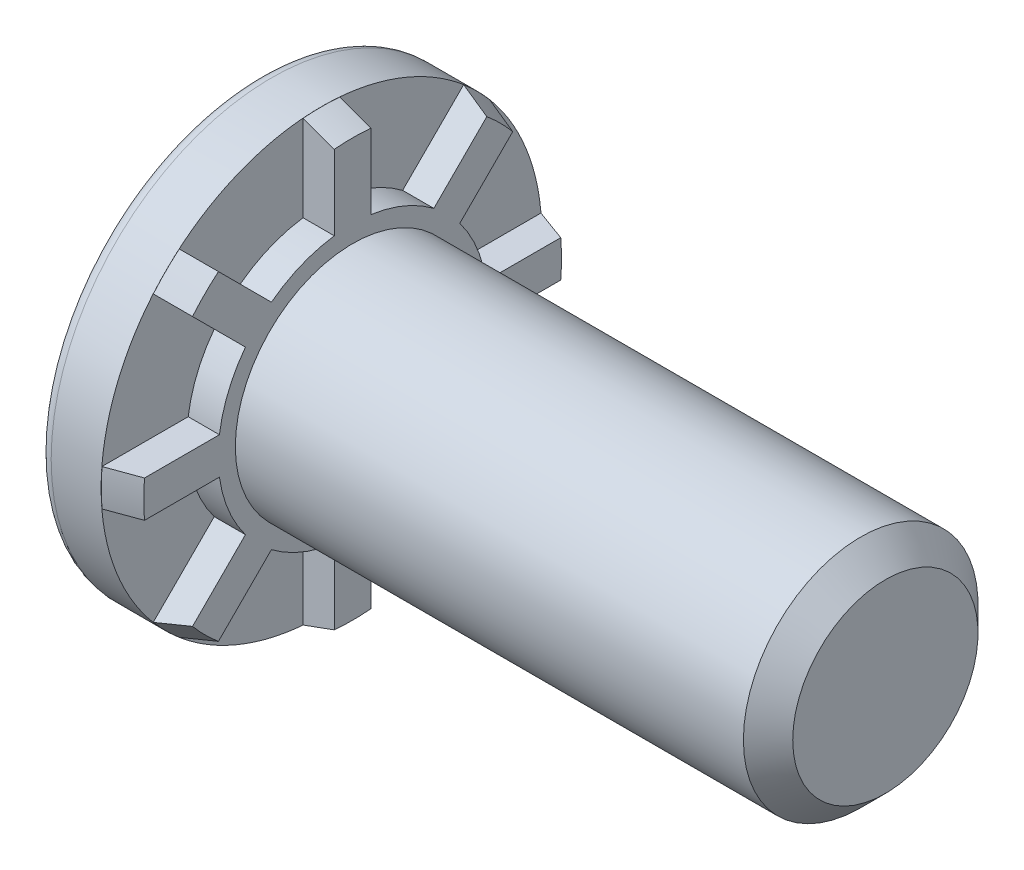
ISO-10303-21;
HEADER;
FILE_DESCRIPTION(('STEP AP214'),'2;1');
FILE_NAME('part.step','',(''),(''),'','','');
FILE_SCHEMA(('AUTOMOTIVE_DESIGN { 1 0 10303 214 1 1 1 1 }'));
ENDSEC;
DATA;
#1=APPLICATION_CONTEXT('core data for automotive mechanical design processes');
#2=APPLICATION_PROTOCOL_DEFINITION('international standard','automotive_design',2000,#1);
#3=PRODUCT_CONTEXT('',#1,'mechanical');
#4=PRODUCT('Part','Part','',(#3));
#5=PRODUCT_RELATED_PRODUCT_CATEGORY('part','',(#4));
#6=PRODUCT_DEFINITION_FORMATION('','',#4);
#7=PRODUCT_DEFINITION_CONTEXT('part definition',#1,'design');
#8=PRODUCT_DEFINITION('design','',#6,#7);
#9=PRODUCT_DEFINITION_SHAPE('','',#8);
#10=(LENGTH_UNIT() NAMED_UNIT(*) SI_UNIT(.MILLI.,.METRE.));
#11=(NAMED_UNIT(*) PLANE_ANGLE_UNIT() SI_UNIT($,.RADIAN.));
#12=(NAMED_UNIT(*) SI_UNIT($,.STERADIAN.) SOLID_ANGLE_UNIT());
#13=UNCERTAINTY_MEASURE_WITH_UNIT(LENGTH_MEASURE(1.E-05),#10,'distance_accuracy_value','');
#14=(GEOMETRIC_REPRESENTATION_CONTEXT(3) GLOBAL_UNCERTAINTY_ASSIGNED_CONTEXT((#13)) GLOBAL_UNIT_ASSIGNED_CONTEXT((#10,
#11,#12)) REPRESENTATION_CONTEXT('',''));
#15=CARTESIAN_POINT('',(0.,0.,0.));
#16=DIRECTION('',(0.,0.,1.));
#17=DIRECTION('',(1.,0.,0.));
#18=AXIS2_PLACEMENT_3D('',#15,#16,#17);
#19=CARTESIAN_POINT('',(0.00254,0.,0.));
#20=DIRECTION('',(-1.,0.,0.));
#21=DIRECTION('',(0.,0.,1.));
#22=AXIS2_PLACEMENT_3D('',#19,#20,#21);
#23=CONICAL_SURFACE('',#22,7.43966,0.349065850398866);
#24=CARTESIAN_POINT('',(1.05429999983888,4.53235558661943,5.40896424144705));
#25=CARTESIAN_POINT('',(0.878977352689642,4.57765248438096,5.45426113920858));
#26=CARTESIAN_POINT('',(0.703652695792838,4.62294549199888,5.4995541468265));
#27=CARTESIAN_POINT('',(0.352999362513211,4.71352372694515,5.59013238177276));
#28=CARTESIAN_POINT('',(0.17767068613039,4.75880895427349,5.63541760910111));
#29=CARTESIAN_POINT('',(0.00234000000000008,4.80409029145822,5.68069894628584));
#30=B_SPLINE_CURVE_WITH_KNOTS('',3,(#24,#25,#26,#27,#28,#29),.UNSPECIFIED.,.F.,.F.,(4,2,4),(0.,
0.559977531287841,1.11995506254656),.UNSPECIFIED.);
#31=CARTESIAN_POINT('',(1.05409999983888,4.53240725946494,5.40901591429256));
#32=VERTEX_POINT('',#31);
#33=CARTESIAN_POINT('',(0.00254,4.80403863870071,5.68064729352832));
#34=VERTEX_POINT('',#33);
#35=EDGE_CURVE('E543',#32,#34,#30,.T.);
#36=ORIENTED_EDGE('',*,*,#35,.F.);
#37=CARTESIAN_POINT('',(1.0541,0.,0.));
#38=DIRECTION('',(-1.,0.,0.));
#39=DIRECTION('',(0.,0.,1.));
#40=AXIS2_PLACEMENT_3D('',#37,#38,#39);
#41=CIRCLE('',#40,7.05692346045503);
#42=CARTESIAN_POINT('',(1.05409999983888,5.40901591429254,4.53240725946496));
#43=VERTEX_POINT('',#42);
#44=EDGE_CURVE('E546',#32,#43,#41,.T.);
#45=ORIENTED_EDGE('',*,*,#44,.T.);
#46=CARTESIAN_POINT('',(0.00234000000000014,5.68069894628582,4.80409029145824));
#47=CARTESIAN_POINT('',(0.17767068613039,5.63541760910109,4.75880895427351));
#48=CARTESIAN_POINT('',(0.352999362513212,5.59013238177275,4.71352372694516));
#49=CARTESIAN_POINT('',(0.703652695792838,5.49955414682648,4.6229454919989));
#50=CARTESIAN_POINT('',(0.878977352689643,5.45426113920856,4.57765248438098));
#51=CARTESIAN_POINT('',(1.05429999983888,5.40896424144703,4.53235558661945));
#52=B_SPLINE_CURVE_WITH_KNOTS('',3,(#46,#47,#48,#49,#50,#51),.UNSPECIFIED.,.F.,.F.,(4,2,4),(0.,
0.559977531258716,1.11995506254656),.UNSPECIFIED.);
#53=CARTESIAN_POINT('',(0.00254,5.68064729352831,4.80403863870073));
#54=VERTEX_POINT('',#53);
#55=EDGE_CURVE('E449',#54,#43,#52,.T.);
#56=ORIENTED_EDGE('',*,*,#55,.F.);
#57=CARTESIAN_POINT('',(0.00254,0.,0.));
#58=DIRECTION('',(-1.,0.,0.));
#59=DIRECTION('',(0.,0.,1.));
#60=AXIS2_PLACEMENT_3D('',#57,#58,#59);
#61=CIRCLE('',#60,7.43966);
#62=EDGE_CURVE('E548',#34,#54,#61,.T.);
#63=ORIENTED_EDGE('',*,*,#62,.F.);
#64=EDGE_LOOP('',(#36,#45,#56,#63));
#65=FACE_BOUND('',#64,.T.);
#66=ADVANCED_FACE('F32',(#65),#23,.T.);
#67=CARTESIAN_POINT('',(1.05429999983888,-5.40896424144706,4.53235558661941));
#68=CARTESIAN_POINT('',(0.878977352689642,-5.45426113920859,4.57765248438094));
#69=CARTESIAN_POINT('',(0.703652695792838,-5.49955414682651,4.62294549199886));
#70=CARTESIAN_POINT('',(0.352999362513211,-5.59013238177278,4.71352372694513));
#71=CARTESIAN_POINT('',(0.17767068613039,-5.63541760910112,4.75880895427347));
#72=CARTESIAN_POINT('',(0.00234000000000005,-5.68069894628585,4.8040902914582));
#73=B_SPLINE_CURVE_WITH_KNOTS('',3,(#67,#68,#69,#70,#71,#72),.UNSPECIFIED.,.F.,.F.,(4,2,4),(0.,
0.55997753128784,1.11995506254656),.UNSPECIFIED.);
#74=CARTESIAN_POINT('',(1.05409999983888,-5.40901591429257,4.53240725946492));
#75=VERTEX_POINT('',#74);
#76=CARTESIAN_POINT('',(0.00254,-5.68064729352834,4.80403863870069));
#77=VERTEX_POINT('',#76);
#78=EDGE_CURVE('E596',#75,#77,#73,.T.);
#79=ORIENTED_EDGE('',*,*,#78,.F.);
#80=CARTESIAN_POINT('',(1.05409999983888,-4.53240725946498,5.40901591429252));
#81=VERTEX_POINT('',#80);
#82=EDGE_CURVE('E560',#75,#81,#41,.T.);
#83=ORIENTED_EDGE('',*,*,#82,.T.);
#84=CARTESIAN_POINT('',(0.00234000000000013,-4.80409029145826,5.68069894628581));
#85=CARTESIAN_POINT('',(0.17767068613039,-4.75880895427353,5.63541760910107));
#86=CARTESIAN_POINT('',(0.352999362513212,-4.71352372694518,5.59013238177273));
#87=CARTESIAN_POINT('',(0.703652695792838,-4.62294549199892,5.49955414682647));
#88=CARTESIAN_POINT('',(0.878977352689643,-4.577652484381,5.45426113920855));
#89=CARTESIAN_POINT('',(1.05429999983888,-4.53235558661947,5.40896424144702));
#90=B_SPLINE_CURVE_WITH_KNOTS('',3,(#84,#85,#86,#87,#88,#89),.UNSPECIFIED.,.F.,.F.,(4,2,4),(0.,
0.559977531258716,1.11995506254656),.UNSPECIFIED.);
#91=CARTESIAN_POINT('',(0.00254,-4.80403863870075,5.68064729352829));
#92=VERTEX_POINT('',#91);
#93=EDGE_CURVE('E594',#92,#81,#90,.T.);
#94=ORIENTED_EDGE('',*,*,#93,.F.);
#95=EDGE_CURVE('E733',#77,#92,#61,.T.);
#96=ORIENTED_EDGE('',*,*,#95,.F.);
#97=EDGE_LOOP('',(#79,#83,#94,#96));
#98=FACE_BOUND('',#97,.T.);
#99=ADVANCED_FACE('F534',(#98),#23,.T.);
#100=CARTESIAN_POINT('',(-5.17022317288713,0.619855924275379,9.30176155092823));
#101=CARTESIAN_POINT('',(-4.21126438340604,0.619855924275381,8.9519492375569));
#102=CARTESIAN_POINT('',(-3.25232985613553,0.619855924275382,8.60207038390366));
#103=CARTESIAN_POINT('',(-1.33454274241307,0.619855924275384,7.90208862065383));
#104=CARTESIAN_POINT('',(-0.37569015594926,0.619855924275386,7.55198571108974));
#105=CARTESIAN_POINT('',(1.54190004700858,0.619855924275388,6.85146471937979));
#106=CARTESIAN_POINT('',(2.50063766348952,0.619855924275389,6.50104663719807));
#107=CARTESIAN_POINT('',(4.41791254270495,0.619855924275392,5.79966241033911));
#108=CARTESIAN_POINT('',(5.3764498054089,0.619855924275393,5.44869626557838));
#109=CARTESIAN_POINT('',(6.33484410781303,0.619855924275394,5.0973396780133));
#110=B_SPLINE_CURVE_WITH_KNOTS('',3,(#100,#101,#102,#103,#104,#105,#106,#107,#108,#109),
.UNSPECIFIED.,.F.,.F.,(4,2,2,2,4),(0.,3.06230886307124,6.12461728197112,9.18692604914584,
12.2492352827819),.UNSPECIFIED.);
#111=CARTESIAN_POINT('',(0.00254,0.619855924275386,7.41379252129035));
#112=VERTEX_POINT('',#111);
#113=CARTESIAN_POINT('',(1.05409999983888,0.619855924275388,7.02964774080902));
#114=VERTEX_POINT('',#113);
#115=EDGE_CURVE('E551',#112,#114,#110,.T.);
#116=ORIENTED_EDGE('',*,*,#115,.F.);
#117=CARTESIAN_POINT('',(0.00254,-0.619855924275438,7.41379252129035));
#118=VERTEX_POINT('',#117);
#119=EDGE_CURVE('E665',#118,#112,#61,.T.);
#120=ORIENTED_EDGE('',*,*,#119,.F.);
#121=CARTESIAN_POINT('',(6.33484410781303,-0.61985592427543,5.09733967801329));
#122=CARTESIAN_POINT('',(5.3764498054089,-0.619855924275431,5.44869626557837));
#123=CARTESIAN_POINT('',(4.41791254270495,-0.619855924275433,5.7996624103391));
#124=CARTESIAN_POINT('',(2.50063766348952,-0.619855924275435,6.50104663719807));
#125=CARTESIAN_POINT('',(1.54190004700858,-0.619855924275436,6.85146471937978));
#126=CARTESIAN_POINT('',(-0.375690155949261,-0.619855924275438,7.55198571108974));
#127=CARTESIAN_POINT('',(-1.33454274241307,-0.619855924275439,7.90208862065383));
#128=CARTESIAN_POINT('',(-3.25232985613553,-0.619855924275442,8.60207038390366));
#129=CARTESIAN_POINT('',(-4.21126438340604,-0.619855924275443,8.9519492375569));
#130=CARTESIAN_POINT('',(-5.17022317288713,-0.619855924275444,9.30176155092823));
#131=B_SPLINE_CURVE_WITH_KNOTS('',3,(#121,#122,#123,#124,#125,#126,#127,#128,#129,#130),
.UNSPECIFIED.,.F.,.F.,(4,2,2,2,4),(0.,3.06230923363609,6.12461800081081,9.18692641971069,
12.2492352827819),.UNSPECIFIED.);
#132=CARTESIAN_POINT('',(1.05409999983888,-0.619855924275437,7.02964774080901));
#133=VERTEX_POINT('',#132);
#134=EDGE_CURVE('E614',#133,#118,#131,.T.);
#135=ORIENTED_EDGE('',*,*,#134,.F.);
#136=EDGE_CURVE('E555',#133,#114,#41,.T.);
#137=ORIENTED_EDGE('',*,*,#136,.T.);
#138=EDGE_LOOP('',(#116,#120,#135,#137));
#139=FACE_BOUND('',#138,.T.);
#140=ADVANCED_FACE('F539',(#139),#23,.T.);
#141=CARTESIAN_POINT('',(6.33484410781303,0.619855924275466,-5.09733967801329));
#142=CARTESIAN_POINT('',(5.3764498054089,0.619855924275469,-5.44869626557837));
#143=CARTESIAN_POINT('',(4.41791254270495,0.619855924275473,-5.7996624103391));
#144=CARTESIAN_POINT('',(2.50063766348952,0.61985592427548,-6.50104663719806));
#145=CARTESIAN_POINT('',(1.54190004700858,0.619855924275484,-6.85146471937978));
#146=CARTESIAN_POINT('',(-0.375690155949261,0.619855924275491,-7.55198571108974));
#147=CARTESIAN_POINT('',(-1.33454274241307,0.619855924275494,-7.90208862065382));
#148=CARTESIAN_POINT('',(-3.25232985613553,0.619855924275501,-8.60207038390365));
#149=CARTESIAN_POINT('',(-4.21126438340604,0.619855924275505,-8.9519492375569));
#150=CARTESIAN_POINT('',(-5.17022317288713,0.619855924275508,-9.30176155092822));
#151=B_SPLINE_CURVE_WITH_KNOTS('',3,(#141,#142,#143,#144,#145,#146,#147,#148,#149,#150),
.UNSPECIFIED.,.F.,.F.,(4,2,2,2,4),(0.,3.06230923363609,6.12461800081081,9.18692641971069,
12.2492352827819),.UNSPECIFIED.);
#152=CARTESIAN_POINT('',(1.05409999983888,0.619855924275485,-7.02964774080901));
#153=VERTEX_POINT('',#152);
#154=CARTESIAN_POINT('',(0.00254,0.619855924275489,-7.41379252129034));
#155=VERTEX_POINT('',#154);
#156=EDGE_CURVE('E680',#153,#155,#151,.T.);
#157=ORIENTED_EDGE('',*,*,#156,.F.);
#158=CARTESIAN_POINT('',(1.05409999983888,-0.619855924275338,-7.02964774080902));
#159=VERTEX_POINT('',#158);
#160=EDGE_CURVE('E562',#153,#159,#41,.T.);
#161=ORIENTED_EDGE('',*,*,#160,.T.);
#162=CARTESIAN_POINT('',(-5.17022317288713,-0.619855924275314,-9.30176155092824));
#163=CARTESIAN_POINT('',(-4.21126438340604,-0.619855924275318,-8.95194923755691));
#164=CARTESIAN_POINT('',(-3.25232985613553,-0.619855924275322,-8.60207038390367));
#165=CARTESIAN_POINT('',(-1.33454274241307,-0.619855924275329,-7.90208862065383));
#166=CARTESIAN_POINT('',(-0.37569015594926,-0.619855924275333,-7.55198571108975));
#167=CARTESIAN_POINT('',(1.54190004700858,-0.61985592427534,-6.85146471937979));
#168=CARTESIAN_POINT('',(2.50063766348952,-0.619855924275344,-6.50104663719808));
#169=CARTESIAN_POINT('',(4.41791254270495,-0.619855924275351,-5.79966241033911));
#170=CARTESIAN_POINT('',(5.3764498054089,-0.619855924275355,-5.44869626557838));
#171=CARTESIAN_POINT('',(6.33484410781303,-0.619855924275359,-5.0973396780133));
#172=B_SPLINE_CURVE_WITH_KNOTS('',3,(#162,#163,#164,#165,#166,#167,#168,#169,#170,#171),
.UNSPECIFIED.,.F.,.F.,(4,2,2,2,4),(0.,3.06230886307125,6.12461728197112,9.18692604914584,
12.2492352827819),.UNSPECIFIED.);
#173=CARTESIAN_POINT('',(0.00254,-0.619855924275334,-7.41379252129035));
#174=VERTEX_POINT('',#173);
#175=EDGE_CURVE('E684',#174,#159,#172,.T.);
#176=ORIENTED_EDGE('',*,*,#175,.F.);
#177=EDGE_CURVE('E658',#155,#174,#61,.T.);
#178=ORIENTED_EDGE('',*,*,#177,.F.);
#179=EDGE_LOOP('',(#157,#161,#176,#178));
#180=FACE_BOUND('',#179,.T.);
#181=ADVANCED_FACE('F909',(#180),#23,.T.);
#182=CARTESIAN_POINT('',(1.05429999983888,-4.5323555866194,-5.40896424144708));
#183=CARTESIAN_POINT('',(0.878977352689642,-4.57765248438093,-5.45426113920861));
#184=CARTESIAN_POINT('',(0.703652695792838,-4.62294549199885,-5.49955414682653));
#185=CARTESIAN_POINT('',(0.352999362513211,-4.71352372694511,-5.59013238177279));
#186=CARTESIAN_POINT('',(0.17767068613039,-4.75880895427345,-5.63541760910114));
#187=CARTESIAN_POINT('',(0.00234000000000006,-4.80409029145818,-5.68069894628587));
#188=B_SPLINE_CURVE_WITH_KNOTS('',3,(#182,#183,#184,#185,#186,#187),.UNSPECIFIED.,.F.,.F.,(4,2,
4),(0.,0.559977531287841,1.11995506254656),.UNSPECIFIED.);
#189=CARTESIAN_POINT('',(1.05409999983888,-4.5324072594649,-5.40901591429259));
#190=VERTEX_POINT('',#189);
#191=CARTESIAN_POINT('',(0.00254,-4.80403863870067,-5.68064729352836));
#192=VERTEX_POINT('',#191);
#193=EDGE_CURVE('E681',#190,#192,#188,.T.);
#194=ORIENTED_EDGE('',*,*,#193,.F.);
#195=CARTESIAN_POINT('',(1.05409999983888,-5.40901591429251,-4.532407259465));
#196=VERTEX_POINT('',#195);
#197=EDGE_CURVE('E573',#190,#196,#41,.T.);
#198=ORIENTED_EDGE('',*,*,#197,.T.);
#199=CARTESIAN_POINT('',(0.00234000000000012,-5.68069894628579,-4.80409029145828));
#200=CARTESIAN_POINT('',(0.17767068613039,-5.63541760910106,-4.75880895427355));
#201=CARTESIAN_POINT('',(0.352999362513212,-5.59013238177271,-4.7135237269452));
#202=CARTESIAN_POINT('',(0.703652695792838,-5.49955414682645,-4.62294549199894));
#203=CARTESIAN_POINT('',(0.878977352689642,-5.45426113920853,-4.57765248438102));
#204=CARTESIAN_POINT('',(1.05429999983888,-5.408964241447,-4.53235558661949));
#205=B_SPLINE_CURVE_WITH_KNOTS('',3,(#199,#200,#201,#202,#203,#204),.UNSPECIFIED.,.F.,.F.,(4,2,
4),(0.,0.559977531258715,1.11995506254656),.UNSPECIFIED.);
#206=CARTESIAN_POINT('',(0.00254,-5.68064729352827,-4.80403863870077));
#207=VERTEX_POINT('',#206);
#208=EDGE_CURVE('E320',#207,#196,#205,.T.);
#209=ORIENTED_EDGE('',*,*,#208,.F.);
#210=EDGE_CURVE('E664',#192,#207,#61,.T.);
#211=ORIENTED_EDGE('',*,*,#210,.F.);
#212=EDGE_LOOP('',(#194,#198,#209,#211));
#213=FACE_BOUND('',#212,.T.);
#214=ADVANCED_FACE('F906',(#213),#23,.T.);
#215=CARTESIAN_POINT('',(-5.17022317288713,-9.30176155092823,0.619855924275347));
#216=CARTESIAN_POINT('',(-4.21126438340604,-8.95194923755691,0.619855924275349));
#217=CARTESIAN_POINT('',(-3.25232985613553,-8.60207038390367,0.619855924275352));
#218=CARTESIAN_POINT('',(-1.33454274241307,-7.90208862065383,0.619855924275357));
#219=CARTESIAN_POINT('',(-0.37569015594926,-7.55198571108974,0.619855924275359));
#220=CARTESIAN_POINT('',(1.54190004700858,-6.85146471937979,0.619855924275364));
#221=CARTESIAN_POINT('',(2.50063766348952,-6.50104663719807,0.619855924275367));
#222=CARTESIAN_POINT('',(4.41791254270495,-5.79966241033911,0.619855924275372));
#223=CARTESIAN_POINT('',(5.3764498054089,-5.44869626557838,0.619855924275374));
#224=CARTESIAN_POINT('',(6.33484410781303,-5.0973396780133,0.619855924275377));
#225=B_SPLINE_CURVE_WITH_KNOTS('',3,(#215,#216,#217,#218,#219,#220,#221,#222,#223,#224),
.UNSPECIFIED.,.F.,.F.,(4,2,2,2,4),(0.,3.06230886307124,6.12461728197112,9.18692604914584,
12.2492352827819),.UNSPECIFIED.);
#226=CARTESIAN_POINT('',(0.00254,-7.41379252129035,0.61985592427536));
#227=VERTEX_POINT('',#226);
#228=CARTESIAN_POINT('',(1.05409999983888,-7.02964774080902,0.619855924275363));
#229=VERTEX_POINT('',#228);
#230=EDGE_CURVE('E732',#227,#229,#225,.T.);
#231=ORIENTED_EDGE('',*,*,#230,.F.);
#232=CARTESIAN_POINT('',(0.00254,-7.41379252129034,-0.619855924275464));
#233=VERTEX_POINT('',#232);
#234=EDGE_CURVE('E726',#233,#227,#61,.T.);
#235=ORIENTED_EDGE('',*,*,#234,.F.);
#236=CARTESIAN_POINT('',(6.33484410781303,-5.09733967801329,-0.619855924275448));
#237=CARTESIAN_POINT('',(5.3764498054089,-5.44869626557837,-0.619855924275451));
#238=CARTESIAN_POINT('',(4.41791254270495,-5.7996624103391,-0.619855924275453));
#239=CARTESIAN_POINT('',(2.50063766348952,-6.50104663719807,-0.619855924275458));
#240=CARTESIAN_POINT('',(1.54190004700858,-6.85146471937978,-0.61985592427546));
#241=CARTESIAN_POINT('',(-0.375690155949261,-7.55198571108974,-0.619855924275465));
#242=CARTESIAN_POINT('',(-1.33454274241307,-7.90208862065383,-0.619855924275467));
#243=CARTESIAN_POINT('',(-3.25232985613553,-8.60207038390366,-0.619855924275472));
#244=CARTESIAN_POINT('',(-4.21126438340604,-8.9519492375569,-0.619855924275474));
#245=CARTESIAN_POINT('',(-5.17022317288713,-9.30176155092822,-0.619855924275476));
#246=B_SPLINE_CURVE_WITH_KNOTS('',3,(#236,#237,#238,#239,#240,#241,#242,#243,#244,#245),
.UNSPECIFIED.,.F.,.F.,(4,2,2,2,4),(0.,3.06230923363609,6.12461800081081,9.18692641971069,
12.2492352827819),.UNSPECIFIED.);
#247=CARTESIAN_POINT('',(1.05409999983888,-7.02964774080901,-0.619855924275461));
#248=VERTEX_POINT('',#247);
#249=EDGE_CURVE('E419',#248,#233,#246,.T.);
#250=ORIENTED_EDGE('',*,*,#249,.F.);
#251=EDGE_CURVE('E579',#248,#229,#41,.T.);
#252=ORIENTED_EDGE('',*,*,#251,.T.);
#253=EDGE_LOOP('',(#231,#235,#250,#252));
#254=FACE_BOUND('',#253,.T.);
#255=ADVANCED_FACE('F731',(#254),#23,.T.);
#256=CARTESIAN_POINT('',(0.,0.,0.));
#257=DIRECTION('',(-1.,0.,0.));
#258=DIRECTION('',(0.,0.,1.));
#259=AXIS2_PLACEMENT_3D('',#256,#257,#258);
#260=CYLINDRICAL_SURFACE('',#259,7.43966);
#261=CARTESIAN_POINT('',(0.,0.,0.));
#262=DIRECTION('',(-1.,0.,0.));
#263=DIRECTION('',(0.,0.,1.));
#264=AXIS2_PLACEMENT_3D('',#261,#262,#263);
#265=CIRCLE('',#264,7.43966);
#266=CARTESIAN_POINT('',(0.,4.80403863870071,5.68064729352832));
#267=VERTEX_POINT('',#266);
#268=CARTESIAN_POINT('',(-1.61121550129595E-10,5.68064729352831,4.80403863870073));
#269=VERTEX_POINT('',#268);
#270=EDGE_CURVE('E623',#267,#269,#265,.T.);
#271=ORIENTED_EDGE('',*,*,#270,.F.);
#272=DIRECTION('',(-1.,0.,0.));
#273=VECTOR('',#272,1.);
#274=CARTESIAN_POINT('',(0.,4.80403863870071,5.68064729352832));
#275=LINE('',#274,#273);
#276=EDGE_CURVE('E11',#267,#34,#275,.F.);
#277=ORIENTED_EDGE('',*,*,#276,.T.);
#278=ORIENTED_EDGE('',*,*,#62,.T.);
#279=DIRECTION('',(-1.,0.,0.));
#280=VECTOR('',#279,1.);
#281=CARTESIAN_POINT('',(0.,5.68064729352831,4.80403863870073));
#282=LINE('',#281,#280);
#283=EDGE_CURVE('E675',#54,#269,#282,.T.);
#284=ORIENTED_EDGE('',*,*,#283,.T.);
#285=EDGE_LOOP('',(#271,#277,#278,#284));
#286=FACE_BOUND('',#285,.T.);
#287=ADVANCED_FACE('F496',(#286),#260,.T.);
#288=CARTESIAN_POINT('',(0.,-5.68064729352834,4.80403863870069));
#289=VERTEX_POINT('',#288);
#290=CARTESIAN_POINT('',(-1.61121550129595E-10,-4.80403863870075,5.68064729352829));
#291=VERTEX_POINT('',#290);
#292=EDGE_CURVE('E622',#289,#291,#265,.T.);
#293=ORIENTED_EDGE('',*,*,#292,.F.);
#294=DIRECTION('',(-1.,0.,0.));
#295=VECTOR('',#294,1.);
#296=CARTESIAN_POINT('',(0.,-5.68064729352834,4.80403863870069));
#297=LINE('',#296,#295);
#298=EDGE_CURVE('E836',#289,#77,#297,.F.);
#299=ORIENTED_EDGE('',*,*,#298,.T.);
#300=ORIENTED_EDGE('',*,*,#95,.T.);
#301=DIRECTION('',(-1.,0.,0.));
#302=VECTOR('',#301,1.);
#303=CARTESIAN_POINT('',(0.,-4.80403863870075,5.68064729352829));
#304=LINE('',#303,#302);
#305=EDGE_CURVE('E619',#92,#291,#304,.T.);
#306=ORIENTED_EDGE('',*,*,#305,.T.);
#307=EDGE_LOOP('',(#293,#299,#300,#306));
#308=FACE_BOUND('',#307,.T.);
#309=ADVANCED_FACE('F839',(#308),#260,.T.);
#310=ORIENTED_EDGE('',*,*,#119,.T.);
#311=DIRECTION('',(-1.,0.,0.));
#312=VECTOR('',#311,1.);
#313=CARTESIAN_POINT('',(0.,0.619855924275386,7.41379252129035));
#314=LINE('',#313,#312);
#315=CARTESIAN_POINT('',(-1.61121550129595E-10,0.619855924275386,7.41379252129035));
#316=VERTEX_POINT('',#315);
#317=EDGE_CURVE('E41',#112,#316,#314,.T.);
#318=ORIENTED_EDGE('',*,*,#317,.T.);
#319=CARTESIAN_POINT('',(0.,-0.619855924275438,7.41379252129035));
#320=VERTEX_POINT('',#319);
#321=EDGE_CURVE('E296',#320,#316,#265,.T.);
#322=ORIENTED_EDGE('',*,*,#321,.F.);
#323=DIRECTION('',(-1.,0.,0.));
#324=VECTOR('',#323,1.);
#325=CARTESIAN_POINT('',(0.,-0.619855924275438,7.41379252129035));
#326=LINE('',#325,#324);
#327=EDGE_CURVE('E612',#320,#118,#326,.F.);
#328=ORIENTED_EDGE('',*,*,#327,.T.);
#329=EDGE_LOOP('',(#310,#318,#322,#328));
#330=FACE_BOUND('',#329,.T.);
#331=ADVANCED_FACE('F621',(#330),#260,.T.);
#332=CARTESIAN_POINT('',(0.,0.619855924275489,-7.41379252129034));
#333=VERTEX_POINT('',#332);
#334=CARTESIAN_POINT('',(-1.61121550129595E-10,-0.619855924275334,-7.41379252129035));
#335=VERTEX_POINT('',#334);
#336=EDGE_CURVE('E631',#333,#335,#265,.T.);
#337=ORIENTED_EDGE('',*,*,#336,.F.);
#338=DIRECTION('',(-1.,0.,0.));
#339=VECTOR('',#338,1.);
#340=CARTESIAN_POINT('',(0.,0.619855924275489,-7.41379252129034));
#341=LINE('',#340,#339);
#342=EDGE_CURVE('E840',#333,#155,#341,.F.);
#343=ORIENTED_EDGE('',*,*,#342,.T.);
#344=ORIENTED_EDGE('',*,*,#177,.T.);
#345=DIRECTION('',(-1.,0.,0.));
#346=VECTOR('',#345,1.);
#347=CARTESIAN_POINT('',(0.,-0.619855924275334,-7.41379252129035));
#348=LINE('',#347,#346);
#349=EDGE_CURVE('E728',#174,#335,#348,.T.);
#350=ORIENTED_EDGE('',*,*,#349,.T.);
#351=EDGE_LOOP('',(#337,#343,#344,#350));
#352=FACE_BOUND('',#351,.T.);
#353=ADVANCED_FACE('F818',(#352),#260,.T.);
#354=CARTESIAN_POINT('',(0.,-4.80403863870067,-5.68064729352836));
#355=VERTEX_POINT('',#354);
#356=CARTESIAN_POINT('',(-1.61121550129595E-10,-5.68064729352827,-4.80403863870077));
#357=VERTEX_POINT('',#356);
#358=EDGE_CURVE('E824',#355,#357,#265,.T.);
#359=ORIENTED_EDGE('',*,*,#358,.F.);
#360=DIRECTION('',(-1.,0.,0.));
#361=VECTOR('',#360,1.);
#362=CARTESIAN_POINT('',(0.,-4.80403863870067,-5.68064729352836));
#363=LINE('',#362,#361);
#364=EDGE_CURVE('E820',#355,#192,#363,.F.);
#365=ORIENTED_EDGE('',*,*,#364,.T.);
#366=ORIENTED_EDGE('',*,*,#210,.T.);
#367=DIRECTION('',(-1.,0.,0.));
#368=VECTOR('',#367,1.);
#369=CARTESIAN_POINT('',(0.,-5.68064729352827,-4.80403863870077));
#370=LINE('',#369,#368);
#371=EDGE_CURVE('E729',#207,#357,#370,.T.);
#372=ORIENTED_EDGE('',*,*,#371,.T.);
#373=EDGE_LOOP('',(#359,#365,#366,#372));
#374=FACE_BOUND('',#373,.T.);
#375=ADVANCED_FACE('F896',(#374),#260,.T.);
#376=ORIENTED_EDGE('',*,*,#234,.T.);
#377=DIRECTION('',(-1.,0.,0.));
#378=VECTOR('',#377,1.);
#379=CARTESIAN_POINT('',(0.,-7.41379252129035,0.61985592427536));
#380=LINE('',#379,#378);
#381=CARTESIAN_POINT('',(-1.61121550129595E-10,-7.41379252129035,0.61985592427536));
#382=VERTEX_POINT('',#381);
#383=EDGE_CURVE('E618',#227,#382,#380,.T.);
#384=ORIENTED_EDGE('',*,*,#383,.T.);
#385=CARTESIAN_POINT('',(0.,-7.41379252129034,-0.619855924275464));
#386=VERTEX_POINT('',#385);
#387=EDGE_CURVE('E625',#386,#382,#265,.T.);
#388=ORIENTED_EDGE('',*,*,#387,.F.);
#389=DIRECTION('',(-1.,0.,0.));
#390=VECTOR('',#389,1.);
#391=CARTESIAN_POINT('',(0.,-7.41379252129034,-0.619855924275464));
#392=LINE('',#391,#390);
#393=EDGE_CURVE('E718',#386,#233,#392,.F.);
#394=ORIENTED_EDGE('',*,*,#393,.T.);
#395=EDGE_LOOP('',(#376,#384,#388,#394));
#396=FACE_BOUND('',#395,.T.);
#397=ADVANCED_FACE('F724',(#396),#260,.T.);
#398=CARTESIAN_POINT('',(6.33484410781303,5.0973396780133,0.619855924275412));
#399=CARTESIAN_POINT('',(5.3764498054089,5.44869626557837,0.619855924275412));
#400=CARTESIAN_POINT('',(4.41791254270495,5.7996624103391,0.619855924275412));
#401=CARTESIAN_POINT('',(2.50063766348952,6.50104663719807,0.619855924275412));
#402=CARTESIAN_POINT('',(1.54190004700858,6.85146471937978,0.619855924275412));
#403=CARTESIAN_POINT('',(-0.375690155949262,7.55198571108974,0.619855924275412));
#404=CARTESIAN_POINT('',(-1.33454274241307,7.90208862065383,0.619855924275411));
#405=CARTESIAN_POINT('',(-3.25232985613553,8.60207038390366,0.619855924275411));
#406=CARTESIAN_POINT('',(-4.21126438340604,8.9519492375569,0.619855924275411));
#407=CARTESIAN_POINT('',(-5.17022317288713,9.30176155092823,0.619855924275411));
#408=B_SPLINE_CURVE_WITH_KNOTS('',3,(#398,#399,#400,#401,#402,#403,#404,#405,#406,#407),
.UNSPECIFIED.,.F.,.F.,(4,2,2,2,4),(0.,3.06230923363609,6.12461800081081,9.18692641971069,
12.2492352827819),.UNSPECIFIED.);
#409=CARTESIAN_POINT('',(1.05409999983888,7.02964774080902,0.619855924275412));
#410=VERTEX_POINT('',#409);
#411=CARTESIAN_POINT('',(0.00254,7.41379252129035,0.619855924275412));
#412=VERTEX_POINT('',#411);
#413=EDGE_CURVE('E442',#410,#412,#408,.T.);
#414=ORIENTED_EDGE('',*,*,#413,.F.);
#415=CARTESIAN_POINT('',(1.05409999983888,7.02964774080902,-0.619855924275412));
#416=VERTEX_POINT('',#415);
#417=EDGE_CURVE('E556',#410,#416,#41,.T.);
#418=ORIENTED_EDGE('',*,*,#417,.T.);
#419=CARTESIAN_POINT('',(-5.17022317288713,9.30176155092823,-0.619855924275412));
#420=CARTESIAN_POINT('',(-4.21126438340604,8.9519492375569,-0.619855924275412));
#421=CARTESIAN_POINT('',(-3.25232985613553,8.60207038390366,-0.619855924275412));
#422=CARTESIAN_POINT('',(-1.33454274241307,7.90208862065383,-0.619855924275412));
#423=CARTESIAN_POINT('',(-0.37569015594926,7.55198571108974,-0.619855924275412));
#424=CARTESIAN_POINT('',(1.54190004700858,6.85146471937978,-0.619855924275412));
#425=CARTESIAN_POINT('',(2.50063766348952,6.50104663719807,-0.619855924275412));
#426=CARTESIAN_POINT('',(4.41791254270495,5.7996624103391,-0.619855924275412));
#427=CARTESIAN_POINT('',(5.3764498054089,5.44869626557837,-0.619855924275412));
#428=CARTESIAN_POINT('',(6.33484410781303,5.0973396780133,-0.619855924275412));
#429=B_SPLINE_CURVE_WITH_KNOTS('',3,(#419,#420,#421,#422,#423,#424,#425,#426,#427,#428),
.UNSPECIFIED.,.F.,.F.,(4,2,2,2,4),(0.,3.06230886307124,6.12461728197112,9.18692604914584,
12.2492352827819),.UNSPECIFIED.);
#430=CARTESIAN_POINT('',(0.00254,7.41379252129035,-0.619855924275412));
#431=VERTEX_POINT('',#430);
#432=EDGE_CURVE('E470',#431,#416,#429,.T.);
#433=ORIENTED_EDGE('',*,*,#432,.F.);
#434=EDGE_CURVE('E659',#412,#431,#61,.T.);
#435=ORIENTED_EDGE('',*,*,#434,.F.);
#436=EDGE_LOOP('',(#414,#418,#433,#435));
#437=FACE_BOUND('',#436,.T.);
#438=ADVANCED_FACE('F530',(#437),#23,.T.);
#439=CARTESIAN_POINT('',(0.,7.41379252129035,0.619855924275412));
#440=VERTEX_POINT('',#439);
#441=CARTESIAN_POINT('',(-1.61121550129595E-10,7.41379252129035,-0.619855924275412));
#442=VERTEX_POINT('',#441);
#443=EDGE_CURVE('E626',#440,#442,#265,.T.);
#444=ORIENTED_EDGE('',*,*,#443,.F.);
#445=DIRECTION('',(-1.,0.,0.));
#446=VECTOR('',#445,1.);
#447=CARTESIAN_POINT('',(0.,7.41379252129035,0.619855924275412));
#448=LINE('',#447,#446);
#449=EDGE_CURVE('E851',#440,#412,#448,.F.);
#450=ORIENTED_EDGE('',*,*,#449,.T.);
#451=ORIENTED_EDGE('',*,*,#434,.T.);
#452=DIRECTION('',(-1.,0.,0.));
#453=VECTOR('',#452,1.);
#454=CARTESIAN_POINT('',(0.,7.41379252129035,-0.619855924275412));
#455=LINE('',#454,#453);
#456=EDGE_CURVE('E566',#431,#442,#455,.T.);
#457=ORIENTED_EDGE('',*,*,#456,.T.);
#458=EDGE_LOOP('',(#444,#450,#451,#457));
#459=FACE_BOUND('',#458,.T.);
#460=ADVANCED_FACE('F497',(#459),#260,.T.);
#461=CARTESIAN_POINT('',(0.00234,4.8040902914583,-5.68069894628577));
#462=CARTESIAN_POINT('',(0.17767068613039,4.75880895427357,-5.63541760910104));
#463=CARTESIAN_POINT('',(0.352999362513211,4.71352372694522,-5.5901323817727));
#464=CARTESIAN_POINT('',(0.703652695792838,4.62294549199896,-5.49955414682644));
#465=CARTESIAN_POINT('',(0.878977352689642,4.57765248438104,-5.45426113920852));
#466=CARTESIAN_POINT('',(1.05429999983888,4.53235558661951,-5.40896424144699));
#467=B_SPLINE_CURVE_WITH_KNOTS('',3,(#461,#462,#463,#464,#465,#466),.UNSPECIFIED.,.F.,.F.,(4,2,
4),(0.,0.559977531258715,1.11995506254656),.UNSPECIFIED.);
#468=CARTESIAN_POINT('',(0.00254,4.80403863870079,-5.68064729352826));
#469=VERTEX_POINT('',#468);
#470=CARTESIAN_POINT('',(1.05409999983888,4.53240725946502,-5.40901591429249));
#471=VERTEX_POINT('',#470);
#472=EDGE_CURVE('E677',#469,#471,#467,.T.);
#473=ORIENTED_EDGE('',*,*,#472,.F.);
#474=CARTESIAN_POINT('',(0.00254,5.68064729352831,-4.80403863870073));
#475=VERTEX_POINT('',#474);
#476=EDGE_CURVE('E632',#475,#469,#61,.T.);
#477=ORIENTED_EDGE('',*,*,#476,.F.);
#478=CARTESIAN_POINT('',(1.05429999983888,5.40896424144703,-4.53235558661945));
#479=CARTESIAN_POINT('',(0.878977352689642,5.45426113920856,-4.57765248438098));
#480=CARTESIAN_POINT('',(0.703652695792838,5.49955414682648,-4.6229454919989));
#481=CARTESIAN_POINT('',(0.352999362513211,5.59013238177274,-4.71352372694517));
#482=CARTESIAN_POINT('',(0.17767068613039,5.63541760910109,-4.75880895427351));
#483=CARTESIAN_POINT('',(0.00234000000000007,5.68069894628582,-4.80409029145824));
#484=B_SPLINE_CURVE_WITH_KNOTS('',3,(#478,#479,#480,#481,#482,#483),.UNSPECIFIED.,.F.,.F.,(4,2,
4),(0.,0.559977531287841,1.11995506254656),.UNSPECIFIED.);
#485=CARTESIAN_POINT('',(1.05409999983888,5.40901591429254,-4.53240725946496));
#486=VERTEX_POINT('',#485);
#487=EDGE_CURVE('E479',#486,#475,#484,.T.);
#488=ORIENTED_EDGE('',*,*,#487,.F.);
#489=EDGE_CURVE('E558',#486,#471,#41,.T.);
#490=ORIENTED_EDGE('',*,*,#489,.T.);
#491=EDGE_LOOP('',(#473,#477,#488,#490));
#492=FACE_BOUND('',#491,.T.);
#493=ADVANCED_FACE('F34',(#492),#23,.T.);
#494=CARTESIAN_POINT('',(1.0541,7.05692346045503,0.));
#495=DIRECTION('',(1.,0.,0.));
#496=DIRECTION('',(0.,0.,-1.));
#497=AXIS2_PLACEMENT_3D('',#494,#495,#496);
#498=PLANE('',#497);
#499=DIRECTION('',(0.,0.707106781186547,0.707106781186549));
#500=VECTOR('',#499,1.);
#501=CARTESIAN_POINT('',(1.05409999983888,2.74358768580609,3.6201963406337));
#502=LINE('',#501,#500);
#503=CARTESIAN_POINT('',(1.05409999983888,2.74358768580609,3.6201963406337));
#504=VERTEX_POINT('',#503);
#505=EDGE_CURVE('E299',#504,#32,#502,.T.);
#506=ORIENTED_EDGE('',*,*,#505,.F.);
#507=CARTESIAN_POINT('',(1.05409999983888,0.,0.));
#508=DIRECTION('',(-1.,0.,0.));
#509=DIRECTION('',(0.,1.,0.));
#510=AXIS2_PLACEMENT_3D('',#507,#508,#509);
#511=CIRCLE('',#510,4.54236666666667);
#512=CARTESIAN_POINT('',(1.05409999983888,0.619855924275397,4.49987483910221));
#513=VERTEX_POINT('',#512);
#514=EDGE_CURVE('E316',#513,#504,#511,.T.);
#515=ORIENTED_EDGE('',*,*,#514,.F.);
#516=DIRECTION('',(0.,0.,-1.));
#517=VECTOR('',#516,1.);
#518=CARTESIAN_POINT('',(1.05409999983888,0.619855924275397,4.49987483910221));
#519=LINE('',#518,#517);
#520=EDGE_CURVE('E305',#114,#513,#519,.T.);
#521=ORIENTED_EDGE('',*,*,#520,.F.);
#522=ORIENTED_EDGE('',*,*,#136,.F.);
#523=DIRECTION('',(0.,0.,1.));
#524=VECTOR('',#523,1.);
#525=CARTESIAN_POINT('',(1.05409999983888,-0.619855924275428,4.49987483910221));
#526=LINE('',#525,#524);
#527=CARTESIAN_POINT('',(1.05409999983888,-0.619855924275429,4.49987483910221));
#528=VERTEX_POINT('',#527);
#529=EDGE_CURVE('E346',#528,#133,#526,.T.);
#530=ORIENTED_EDGE('',*,*,#529,.F.);
#531=CARTESIAN_POINT('',(1.05409999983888,0.,0.));
#532=DIRECTION('',(-1.,0.,0.));
#533=DIRECTION('',(0.,0.707106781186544,0.707106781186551));
#534=AXIS2_PLACEMENT_3D('',#531,#532,#533);
#535=CIRCLE('',#534,4.54236666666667);
#536=CARTESIAN_POINT('',(1.05409999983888,-2.74358768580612,3.62019634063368));
#537=VERTEX_POINT('',#536);
#538=EDGE_CURVE('E351',#537,#528,#535,.T.);
#539=ORIENTED_EDGE('',*,*,#538,.F.);
#540=DIRECTION('',(0.,0.707106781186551,-0.707106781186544));
#541=VECTOR('',#540,1.);
#542=CARTESIAN_POINT('',(1.05409999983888,-2.74358768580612,3.62019634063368));
#543=LINE('',#542,#541);
#544=EDGE_CURVE('E340',#81,#537,#543,.T.);
#545=ORIENTED_EDGE('',*,*,#544,.F.);
#546=ORIENTED_EDGE('',*,*,#82,.F.);
#547=DIRECTION('',(0.,-0.707106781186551,0.707106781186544));
#548=VECTOR('',#547,1.);
#549=CARTESIAN_POINT('',(1.05409999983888,-3.62019634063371,2.74358768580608));
#550=LINE('',#549,#548);
#551=CARTESIAN_POINT('',(1.05409999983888,-3.62019634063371,2.74358768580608));
#552=VERTEX_POINT('',#551);
#553=EDGE_CURVE('E325',#552,#75,#550,.T.);
#554=ORIENTED_EDGE('',*,*,#553,.F.);
#555=CARTESIAN_POINT('',(1.05409999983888,0.,0.));
#556=DIRECTION('',(-1.,0.,0.));
#557=DIRECTION('',(0.,0.,1.));
#558=AXIS2_PLACEMENT_3D('',#555,#556,#557);
#559=CIRCLE('',#558,4.54236666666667);
#560=CARTESIAN_POINT('',(1.05409999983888,-4.49987483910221,0.619855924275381));
#561=VERTEX_POINT('',#560);
#562=EDGE_CURVE('E333',#561,#552,#559,.T.);
#563=ORIENTED_EDGE('',*,*,#562,.F.);
#564=DIRECTION('',(0.,1.,0.));
#565=VECTOR('',#564,1.);
#566=CARTESIAN_POINT('',(1.05409999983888,-4.49987483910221,0.619855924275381));
#567=LINE('',#566,#565);
#568=EDGE_CURVE('E331',#229,#561,#567,.T.);
#569=ORIENTED_EDGE('',*,*,#568,.F.);
#570=ORIENTED_EDGE('',*,*,#251,.F.);
#571=DIRECTION('',(0.,-1.,0.));
#572=VECTOR('',#571,1.);
#573=CARTESIAN_POINT('',(1.05409999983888,-4.4998748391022,-0.619855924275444));
#574=LINE('',#573,#572);
#575=CARTESIAN_POINT('',(1.05409999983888,-4.4998748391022,-0.619855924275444));
#576=VERTEX_POINT('',#575);
#577=EDGE_CURVE('E400',#576,#248,#574,.T.);
#578=ORIENTED_EDGE('',*,*,#577,.F.);
#579=CARTESIAN_POINT('',(1.05409999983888,0.,0.));
#580=DIRECTION('',(-1.,0.,0.));
#581=DIRECTION('',(0.,-0.707106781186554,0.707106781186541));
#582=AXIS2_PLACEMENT_3D('',#579,#580,#581);
#583=CIRCLE('',#582,4.54236666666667);
#584=CARTESIAN_POINT('',(1.05409999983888,-3.62019634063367,-2.74358768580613));
#585=VERTEX_POINT('',#584);
#586=EDGE_CURVE('E407',#585,#576,#583,.T.);
#587=ORIENTED_EDGE('',*,*,#586,.F.);
#588=DIRECTION('',(0.,0.707106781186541,0.707106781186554));
#589=VECTOR('',#588,1.);
#590=CARTESIAN_POINT('',(1.05409999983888,-3.62019634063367,-2.74358768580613));
#591=LINE('',#590,#589);
#592=EDGE_CURVE('E376',#196,#585,#591,.T.);
#593=ORIENTED_EDGE('',*,*,#592,.F.);
#594=ORIENTED_EDGE('',*,*,#197,.F.);
#595=DIRECTION('',(0.,-0.707106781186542,-0.707106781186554));
#596=VECTOR('',#595,1.);
#597=CARTESIAN_POINT('',(1.05409999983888,-2.74358768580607,-3.62019634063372));
#598=LINE('',#597,#596);
#599=CARTESIAN_POINT('',(1.05409999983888,-2.74358768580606,-3.62019634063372));
#600=VERTEX_POINT('',#599);
#601=EDGE_CURVE('E361',#600,#190,#598,.T.);
#602=ORIENTED_EDGE('',*,*,#601,.F.);
#603=CARTESIAN_POINT('',(1.05409999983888,0.,0.));
#604=DIRECTION('',(-1.,0.,0.));
#605=DIRECTION('',(0.,-1.,0.));
#606=AXIS2_PLACEMENT_3D('',#603,#604,#605);
#607=CIRCLE('',#606,4.54236666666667);
#608=CARTESIAN_POINT('',(1.05409999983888,-0.619855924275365,-4.49987483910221));
#609=VERTEX_POINT('',#608);
#610=EDGE_CURVE('E369',#609,#600,#607,.T.);
#611=ORIENTED_EDGE('',*,*,#610,.F.);
#612=DIRECTION('',(0.,0.,1.));
#613=VECTOR('',#612,1.);
#614=CARTESIAN_POINT('',(1.05409999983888,-0.619855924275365,-4.49987483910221));
#615=LINE('',#614,#613);
#616=EDGE_CURVE('E367',#159,#609,#615,.T.);
#617=ORIENTED_EDGE('',*,*,#616,.F.);
#618=ORIENTED_EDGE('',*,*,#160,.F.);
#619=DIRECTION('',(0.,0.,-1.));
#620=VECTOR('',#619,1.);
#621=CARTESIAN_POINT('',(1.05409999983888,0.61985592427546,-4.4998748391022));
#622=LINE('',#621,#620);
#623=CARTESIAN_POINT('',(1.05409999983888,0.61985592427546,-4.4998748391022));
#624=VERTEX_POINT('',#623);
#625=EDGE_CURVE('E382',#624,#153,#622,.T.);
#626=ORIENTED_EDGE('',*,*,#625,.F.);
#627=CARTESIAN_POINT('',(1.05409999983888,0.,0.));
#628=DIRECTION('',(-1.,0.,0.));
#629=DIRECTION('',(0.,-0.707106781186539,-0.707106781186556));
#630=AXIS2_PLACEMENT_3D('',#627,#628,#629);
#631=CIRCLE('',#630,4.54236666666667);
#632=CARTESIAN_POINT('',(1.05409999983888,2.74358768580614,-3.62019634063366));
#633=VERTEX_POINT('',#632);
#634=EDGE_CURVE('E390',#633,#624,#631,.T.);
#635=ORIENTED_EDGE('',*,*,#634,.F.);
#636=DIRECTION('',(0.,-0.707106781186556,0.707106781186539));
#637=VECTOR('',#636,1.);
#638=CARTESIAN_POINT('',(1.05409999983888,2.74358768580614,-3.62019634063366));
#639=LINE('',#638,#637);
#640=EDGE_CURVE('E388',#471,#633,#639,.T.);
#641=ORIENTED_EDGE('',*,*,#640,.F.);
#642=ORIENTED_EDGE('',*,*,#489,.F.);
#643=DIRECTION('',(0.,0.707106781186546,-0.707106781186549));
#644=VECTOR('',#643,1.);
#645=CARTESIAN_POINT('',(1.05409999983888,3.62019634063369,-2.7435876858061));
#646=LINE('',#645,#644);
#647=CARTESIAN_POINT('',(1.05409999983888,3.62019634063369,-2.7435876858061));
#648=VERTEX_POINT('',#647);
#649=EDGE_CURVE('E457',#648,#486,#646,.T.);
#650=ORIENTED_EDGE('',*,*,#649,.F.);
#651=CARTESIAN_POINT('',(1.05409999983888,0.,0.));
#652=DIRECTION('',(-1.,0.,0.));
#653=DIRECTION('',(0.,0.,-1.));
#654=AXIS2_PLACEMENT_3D('',#651,#652,#653);
#655=CIRCLE('',#654,4.54236666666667);
#656=CARTESIAN_POINT('',(1.05409999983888,4.49987483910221,-0.619855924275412));
#657=VERTEX_POINT('',#656);
#658=EDGE_CURVE('E464',#657,#648,#655,.T.);
#659=ORIENTED_EDGE('',*,*,#658,.F.);
#660=DIRECTION('',(0.,-1.,0.));
#661=VECTOR('',#660,1.);
#662=CARTESIAN_POINT('',(1.05409999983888,4.49987483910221,-0.619855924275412));
#663=LINE('',#662,#661);
#664=EDGE_CURVE('E448',#416,#657,#663,.T.);
#665=ORIENTED_EDGE('',*,*,#664,.F.);
#666=ORIENTED_EDGE('',*,*,#417,.F.);
#667=DIRECTION('',(0.,1.,0.));
#668=VECTOR('',#667,1.);
#669=CARTESIAN_POINT('',(1.05409999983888,4.49987483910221,0.619855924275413));
#670=LINE('',#669,#668);
#671=CARTESIAN_POINT('',(1.05409999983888,4.49987483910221,0.619855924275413));
#672=VERTEX_POINT('',#671);
#673=EDGE_CURVE('E868',#672,#410,#670,.T.);
#674=ORIENTED_EDGE('',*,*,#673,.F.);
#675=CARTESIAN_POINT('',(1.05409999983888,0.,0.));
#676=DIRECTION('',(-1.,0.,0.));
#677=DIRECTION('',(0.,0.707106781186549,-0.707106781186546));
#678=AXIS2_PLACEMENT_3D('',#675,#676,#677);
#679=CIRCLE('',#678,4.54236666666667);
#680=CARTESIAN_POINT('',(1.05409999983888,3.62019634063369,2.7435876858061));
#681=VERTEX_POINT('',#680);
#682=EDGE_CURVE('E870',#681,#672,#679,.T.);
#683=ORIENTED_EDGE('',*,*,#682,.F.);
#684=DIRECTION('',(0.,-0.707106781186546,-0.707106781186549));
#685=VECTOR('',#684,1.);
#686=CARTESIAN_POINT('',(1.05409999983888,3.62019634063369,2.7435876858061));
#687=LINE('',#686,#685);
#688=EDGE_CURVE('E550',#43,#681,#687,.T.);
#689=ORIENTED_EDGE('',*,*,#688,.F.);
#690=ORIENTED_EDGE('',*,*,#44,.F.);
#691=EDGE_LOOP('',(#506,#515,#521,#522,#530,#539,#545,#546,#554,#563,#569,#570,#578,#587,#593,
#594,#602,#611,#617,#618,#626,#635,#641,#642,#650,#659,#665,#666,#674,#683,#689,#690));
#692=FACE_BOUND('',#691,.T.);
#693=CARTESIAN_POINT('',(1.0541,0.,0.));
#694=DIRECTION('',(-1.,0.,0.));
#695=DIRECTION('',(0.,0.,1.));
#696=AXIS2_PLACEMENT_3D('',#693,#694,#695);
#697=CIRCLE('',#696,3.9624);
#698=CARTESIAN_POINT('',(1.0541,0.,3.9624));
#699=VERTEX_POINT('',#698);
#700=EDGE_CURVE('E561',#699,#699,#697,.T.);
#701=ORIENTED_EDGE('',*,*,#700,.T.);
#702=EDGE_LOOP('',(#701));
#703=FACE_BOUND('',#702,.T.);
#704=ADVANCED_FACE('F522',(#692,#703),#498,.T.);
#705=CARTESIAN_POINT('',(0.,0.,0.));
#706=DIRECTION('',(-1.,0.,0.));
#707=DIRECTION('',(0.,0.,1.));
#708=AXIS2_PLACEMENT_3D('',#705,#706,#707);
#709=CYLINDRICAL_SURFACE('',#708,3.9624);
#710=CARTESIAN_POINT('',(18.2168799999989,0.,0.));
#711=DIRECTION('',(-1.,0.,0.));
#712=DIRECTION('',(0.,0.,1.));
#713=AXIS2_PLACEMENT_3D('',#710,#711,#712);
#714=CIRCLE('',#713,3.9624);
#715=CARTESIAN_POINT('',(18.2168799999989,0.,3.9624));
#716=VERTEX_POINT('',#715);
#717=EDGE_CURVE('E644',#716,#716,#714,.T.);
#718=ORIENTED_EDGE('',*,*,#717,.T.);
#719=EDGE_LOOP('',(#718));
#720=FACE_BOUND('',#719,.T.);
#721=ORIENTED_EDGE('',*,*,#700,.F.);
#722=EDGE_LOOP('',(#721));
#723=FACE_BOUND('',#722,.T.);
#724=ADVANCED_FACE('F519',(#720,#723),#709,.T.);
#725=CARTESIAN_POINT('',(19.05,0.,0.));
#726=DIRECTION('',(-1.,0.,0.));
#727=DIRECTION('',(0.,0.,1.));
#728=AXIS2_PLACEMENT_3D('',#725,#726,#727);
#729=CONICAL_SURFACE('',#728,3.12928,0.785398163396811);
#730=ORIENTED_EDGE('',*,*,#717,.F.);
#731=EDGE_LOOP('',(#730));
#732=FACE_BOUND('',#731,.T.);
#733=CARTESIAN_POINT('',(19.05,0.,0.));
#734=DIRECTION('',(-1.,0.,0.));
#735=DIRECTION('',(0.,0.,1.));
#736=AXIS2_PLACEMENT_3D('',#733,#734,#735);
#737=CIRCLE('',#736,3.12928);
#738=CARTESIAN_POINT('',(19.05,0.,3.12928));
#739=VERTEX_POINT('',#738);
#740=EDGE_CURVE('E641',#739,#739,#737,.T.);
#741=ORIENTED_EDGE('',*,*,#740,.T.);
#742=EDGE_LOOP('',(#741));
#743=FACE_BOUND('',#742,.T.);
#744=ADVANCED_FACE('F515',(#732,#743),#729,.T.);
#745=CARTESIAN_POINT('',(19.05,3.12928,0.));
#746=DIRECTION('',(1.,0.,0.));
#747=DIRECTION('',(0.,0.,-1.));
#748=AXIS2_PLACEMENT_3D('',#745,#746,#747);
#749=PLANE('',#748);
#750=ORIENTED_EDGE('',*,*,#740,.F.);
#751=EDGE_LOOP('',(#750));
#752=FACE_BOUND('',#751,.T.);
#753=ADVANCED_FACE('F511',(#752),#749,.T.);
#754=CARTESIAN_POINT('',(-2.1082,7.02056,0.));
#755=DIRECTION('',(1.,0.,0.));
#756=DIRECTION('',(0.,0.,-1.));
#757=AXIS2_PLACEMENT_3D('',#754,#755,#756);
#758=PLANE('',#757);
#759=CARTESIAN_POINT('',(-2.1082,0.,0.));
#760=DIRECTION('',(-1.,0.,0.));
#761=DIRECTION('',(0.,0.,1.));
#762=AXIS2_PLACEMENT_3D('',#759,#760,#761);
#763=CIRCLE('',#762,7.02056);
#764=CARTESIAN_POINT('',(-2.1082,0.,7.02056));
#765=VERTEX_POINT('',#764);
#766=EDGE_CURVE('E638',#765,#765,#763,.T.);
#767=ORIENTED_EDGE('',*,*,#766,.T.);
#768=EDGE_LOOP('',(#767));
#769=FACE_BOUND('',#768,.T.);
#770=ADVANCED_FACE('F507',(#769),#758,.F.);
#771=CARTESIAN_POINT('',(-1.68656,0.,0.));
#772=DIRECTION('',(-1.,0.,0.));
#773=DIRECTION('',(0.,0.,1.));
#774=AXIS2_PLACEMENT_3D('',#771,#772,#773);
#775=TOROIDAL_SURFACE('',#774,7.02056,0.42164);
#776=CARTESIAN_POINT('',(-1.68656,0.,0.));
#777=DIRECTION('',(-1.,0.,0.));
#778=DIRECTION('',(0.,0.,1.));
#779=AXIS2_PLACEMENT_3D('',#776,#777,#778);
#780=CIRCLE('',#779,7.4422);
#781=CARTESIAN_POINT('',(-1.68656,0.,7.4422));
#782=VERTEX_POINT('',#781);
#783=EDGE_CURVE('E635',#782,#782,#780,.T.);
#784=ORIENTED_EDGE('',*,*,#783,.T.);
#785=EDGE_LOOP('',(#784));
#786=FACE_BOUND('',#785,.T.);
#787=ORIENTED_EDGE('',*,*,#766,.F.);
#788=EDGE_LOOP('',(#787));
#789=FACE_BOUND('',#788,.T.);
#790=ADVANCED_FACE('F503',(#786,#789),#775,.T.);
#791=CARTESIAN_POINT('',(0.,0.,0.));
#792=DIRECTION('',(-1.,0.,0.));
#793=DIRECTION('',(0.,0.,1.));
#794=AXIS2_PLACEMENT_3D('',#791,#792,#793);
#795=CYLINDRICAL_SURFACE('',#794,7.4422);
#796=CARTESIAN_POINT('',(0.,0.,0.));
#797=DIRECTION('',(-1.,0.,0.));
#798=DIRECTION('',(0.,0.,1.));
#799=AXIS2_PLACEMENT_3D('',#796,#797,#798);
#800=CIRCLE('',#799,7.4422);
#801=CARTESIAN_POINT('',(0.,0.,7.4422));
#802=VERTEX_POINT('',#801);
#803=EDGE_CURVE('E630',#802,#802,#800,.T.);
#804=ORIENTED_EDGE('',*,*,#803,.T.);
#805=EDGE_LOOP('',(#804));
#806=FACE_BOUND('',#805,.T.);
#807=ORIENTED_EDGE('',*,*,#783,.F.);
#808=EDGE_LOOP('',(#807));
#809=FACE_BOUND('',#808,.T.);
#810=ADVANCED_FACE('F500',(#806,#809),#795,.T.);
#811=CARTESIAN_POINT('',(0.,7.43966,0.));
#812=DIRECTION('',(-1.,0.,0.));
#813=DIRECTION('',(0.,0.,1.));
#814=AXIS2_PLACEMENT_3D('',#811,#812,#813);
#815=PLANE('',#814);
#816=DIRECTION('',(0.,0.707106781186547,0.707106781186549));
#817=VECTOR('',#816,1.);
#818=CARTESIAN_POINT('',(-1.61121550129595E-10,2.74358768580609,3.6201963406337));
#819=LINE('',#818,#817);
#820=CARTESIAN_POINT('',(-1.61121550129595E-10,2.74358768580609,3.6201963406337));
#821=VERTEX_POINT('',#820);
#822=EDGE_CURVE('E48',#821,#267,#819,.T.);
#823=ORIENTED_EDGE('',*,*,#822,.T.);
#824=ORIENTED_EDGE('',*,*,#270,.T.);
#825=DIRECTION('',(0.,-0.707106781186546,-0.707106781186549));
#826=VECTOR('',#825,1.);
#827=CARTESIAN_POINT('',(-1.61121550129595E-10,3.62019634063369,2.7435876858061));
#828=LINE('',#827,#826);
#829=CARTESIAN_POINT('',(-1.61121550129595E-10,3.62019634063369,2.7435876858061));
#830=VERTEX_POINT('',#829);
#831=EDGE_CURVE('E859',#269,#830,#828,.T.);
#832=ORIENTED_EDGE('',*,*,#831,.T.);
#833=CARTESIAN_POINT('',(-1.61121550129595E-10,0.,0.));
#834=DIRECTION('',(-1.,0.,0.));
#835=DIRECTION('',(0.,0.707106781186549,-0.707106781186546));
#836=AXIS2_PLACEMENT_3D('',#833,#834,#835);
#837=CIRCLE('',#836,4.54236666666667);
#838=CARTESIAN_POINT('',(-1.61121550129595E-10,4.49987483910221,0.619855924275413));
#839=VERTEX_POINT('',#838);
#840=EDGE_CURVE('E874',#830,#839,#837,.T.);
#841=ORIENTED_EDGE('',*,*,#840,.T.);
#842=DIRECTION('',(0.,1.,0.));
#843=VECTOR('',#842,1.);
#844=CARTESIAN_POINT('',(-1.61121550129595E-10,4.49987483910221,0.619855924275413));
#845=LINE('',#844,#843);
#846=EDGE_CURVE('E866',#839,#440,#845,.T.);
#847=ORIENTED_EDGE('',*,*,#846,.T.);
#848=ORIENTED_EDGE('',*,*,#443,.T.);
#849=DIRECTION('',(0.,-1.,0.));
#850=VECTOR('',#849,1.);
#851=CARTESIAN_POINT('',(-1.61121550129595E-10,4.49987483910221,-0.619855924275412));
#852=LINE('',#851,#850);
#853=CARTESIAN_POINT('',(-1.61121550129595E-10,4.49987483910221,-0.619855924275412));
#854=VERTEX_POINT('',#853);
#855=EDGE_CURVE('E454',#442,#854,#852,.T.);
#856=ORIENTED_EDGE('',*,*,#855,.T.);
#857=CARTESIAN_POINT('',(-1.61121550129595E-10,0.,0.));
#858=DIRECTION('',(-1.,0.,0.));
#859=DIRECTION('',(0.,0.,-1.));
#860=AXIS2_PLACEMENT_3D('',#857,#858,#859);
#861=CIRCLE('',#860,4.54236666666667);
#862=CARTESIAN_POINT('',(-1.61121550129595E-10,3.62019634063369,-2.7435876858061));
#863=VERTEX_POINT('',#862);
#864=EDGE_CURVE('E456',#854,#863,#861,.T.);
#865=ORIENTED_EDGE('',*,*,#864,.T.);
#866=DIRECTION('',(0.,0.707106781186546,-0.707106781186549));
#867=VECTOR('',#866,1.);
#868=CARTESIAN_POINT('',(-1.61121550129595E-10,3.62019634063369,-2.7435876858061));
#869=LINE('',#868,#867);
#870=CARTESIAN_POINT('',(0.,5.68064729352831,-4.80403863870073));
#871=VERTEX_POINT('',#870);
#872=EDGE_CURVE('E460',#863,#871,#869,.T.);
#873=ORIENTED_EDGE('',*,*,#872,.T.);
#874=CARTESIAN_POINT('',(-1.61121550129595E-10,4.80403863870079,-5.68064729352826));
#875=VERTEX_POINT('',#874);
#876=EDGE_CURVE('E627',#871,#875,#265,.T.);
#877=ORIENTED_EDGE('',*,*,#876,.T.);
#878=DIRECTION('',(0.,-0.707106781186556,0.707106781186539));
#879=VECTOR('',#878,1.);
#880=CARTESIAN_POINT('',(-1.61121550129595E-10,2.74358768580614,-3.62019634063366));
#881=LINE('',#880,#879);
#882=CARTESIAN_POINT('',(-1.61121550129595E-10,2.74358768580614,-3.62019634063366));
#883=VERTEX_POINT('',#882);
#884=EDGE_CURVE('E379',#875,#883,#881,.T.);
#885=ORIENTED_EDGE('',*,*,#884,.T.);
#886=CARTESIAN_POINT('',(-1.61121550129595E-10,0.,0.));
#887=DIRECTION('',(-1.,0.,0.));
#888=DIRECTION('',(0.,-0.707106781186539,-0.707106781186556));
#889=AXIS2_PLACEMENT_3D('',#886,#887,#888);
#890=CIRCLE('',#889,4.54236666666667);
#891=CARTESIAN_POINT('',(-1.61121550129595E-10,0.61985592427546,-4.4998748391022));
#892=VERTEX_POINT('',#891);
#893=EDGE_CURVE('E381',#883,#892,#890,.T.);
#894=ORIENTED_EDGE('',*,*,#893,.T.);
#895=DIRECTION('',(0.,0.,-1.));
#896=VECTOR('',#895,1.);
#897=CARTESIAN_POINT('',(-1.61121550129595E-10,0.61985592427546,-4.4998748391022));
#898=LINE('',#897,#896);
#899=EDGE_CURVE('E385',#892,#333,#898,.T.);
#900=ORIENTED_EDGE('',*,*,#899,.T.);
#901=ORIENTED_EDGE('',*,*,#336,.T.);
#902=DIRECTION('',(0.,0.,1.));
#903=VECTOR('',#902,1.);
#904=CARTESIAN_POINT('',(-1.61121550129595E-10,-0.619855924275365,-4.49987483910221));
#905=LINE('',#904,#903);
#906=CARTESIAN_POINT('',(-1.61121550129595E-10,-0.619855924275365,-4.49987483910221));
#907=VERTEX_POINT('',#906);
#908=EDGE_CURVE('E358',#335,#907,#905,.T.);
#909=ORIENTED_EDGE('',*,*,#908,.T.);
#910=CARTESIAN_POINT('',(-1.61121550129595E-10,0.,0.));
#911=DIRECTION('',(-1.,0.,0.));
#912=DIRECTION('',(0.,-1.,0.));
#913=AXIS2_PLACEMENT_3D('',#910,#911,#912);
#914=CIRCLE('',#913,4.54236666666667);
#915=CARTESIAN_POINT('',(-1.61121550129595E-10,-2.74358768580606,-3.62019634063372));
#916=VERTEX_POINT('',#915);
#917=EDGE_CURVE('E360',#907,#916,#914,.T.);
#918=ORIENTED_EDGE('',*,*,#917,.T.);
#919=DIRECTION('',(0.,-0.707106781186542,-0.707106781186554));
#920=VECTOR('',#919,1.);
#921=CARTESIAN_POINT('',(-1.61121550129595E-10,-2.74358768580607,-3.62019634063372));
#922=LINE('',#921,#920);
#923=EDGE_CURVE('E364',#916,#355,#922,.T.);
#924=ORIENTED_EDGE('',*,*,#923,.T.);
#925=ORIENTED_EDGE('',*,*,#358,.T.);
#926=DIRECTION('',(0.,0.707106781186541,0.707106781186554));
#927=VECTOR('',#926,1.);
#928=CARTESIAN_POINT('',(-1.61121550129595E-10,-3.62019634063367,-2.74358768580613));
#929=LINE('',#928,#927);
#930=CARTESIAN_POINT('',(-1.61121550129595E-10,-3.62019634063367,-2.74358768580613));
#931=VERTEX_POINT('',#930);
#932=EDGE_CURVE('E397',#357,#931,#929,.T.);
#933=ORIENTED_EDGE('',*,*,#932,.T.);
#934=CARTESIAN_POINT('',(-1.61121550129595E-10,0.,0.));
#935=DIRECTION('',(-1.,0.,0.));
#936=DIRECTION('',(0.,-0.707106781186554,0.707106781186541));
#937=AXIS2_PLACEMENT_3D('',#934,#935,#936);
#938=CIRCLE('',#937,4.54236666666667);
#939=CARTESIAN_POINT('',(-1.61121550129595E-10,-4.4998748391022,-0.619855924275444));
#940=VERTEX_POINT('',#939);
#941=EDGE_CURVE('E399',#931,#940,#938,.T.);
#942=ORIENTED_EDGE('',*,*,#941,.T.);
#943=DIRECTION('',(0.,-1.,0.));
#944=VECTOR('',#943,1.);
#945=CARTESIAN_POINT('',(-1.61121550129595E-10,-4.4998748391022,-0.619855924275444));
#946=LINE('',#945,#944);
#947=EDGE_CURVE('E403',#940,#386,#946,.T.);
#948=ORIENTED_EDGE('',*,*,#947,.T.);
#949=ORIENTED_EDGE('',*,*,#387,.T.);
#950=DIRECTION('',(0.,1.,0.));
#951=VECTOR('',#950,1.);
#952=CARTESIAN_POINT('',(-1.61121550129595E-10,-4.49987483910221,0.619855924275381));
#953=LINE('',#952,#951);
#954=CARTESIAN_POINT('',(-1.61121550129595E-10,-4.49987483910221,0.619855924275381));
#955=VERTEX_POINT('',#954);
#956=EDGE_CURVE('E322',#382,#955,#953,.T.);
#957=ORIENTED_EDGE('',*,*,#956,.T.);
#958=CARTESIAN_POINT('',(-1.61121550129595E-10,0.,0.));
#959=DIRECTION('',(-1.,0.,0.));
#960=DIRECTION('',(0.,0.,1.));
#961=AXIS2_PLACEMENT_3D('',#958,#959,#960);
#962=CIRCLE('',#961,4.54236666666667);
#963=CARTESIAN_POINT('',(-1.61121550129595E-10,-3.62019634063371,2.74358768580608));
#964=VERTEX_POINT('',#963);
#965=EDGE_CURVE('E324',#955,#964,#962,.T.);
#966=ORIENTED_EDGE('',*,*,#965,.T.);
#967=DIRECTION('',(0.,-0.707106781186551,0.707106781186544));
#968=VECTOR('',#967,1.);
#969=CARTESIAN_POINT('',(-1.61121550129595E-10,-3.62019634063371,2.74358768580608));
#970=LINE('',#969,#968);
#971=EDGE_CURVE('E328',#964,#289,#970,.T.);
#972=ORIENTED_EDGE('',*,*,#971,.T.);
#973=ORIENTED_EDGE('',*,*,#292,.T.);
#974=DIRECTION('',(0.,0.707106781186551,-0.707106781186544));
#975=VECTOR('',#974,1.);
#976=CARTESIAN_POINT('',(-1.61121550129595E-10,-2.74358768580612,3.62019634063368));
#977=LINE('',#976,#975);
#978=CARTESIAN_POINT('',(-1.61121550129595E-10,-2.74358768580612,3.62019634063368));
#979=VERTEX_POINT('',#978);
#980=EDGE_CURVE('E343',#291,#979,#977,.T.);
#981=ORIENTED_EDGE('',*,*,#980,.T.);
#982=CARTESIAN_POINT('',(-1.61121550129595E-10,0.,0.));
#983=DIRECTION('',(-1.,0.,0.));
#984=DIRECTION('',(0.,0.707106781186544,0.707106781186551));
#985=AXIS2_PLACEMENT_3D('',#982,#983,#984);
#986=CIRCLE('',#985,4.54236666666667);
#987=CARTESIAN_POINT('',(-1.61121550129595E-10,-0.619855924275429,4.49987483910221));
#988=VERTEX_POINT('',#987);
#989=EDGE_CURVE('E345',#979,#988,#986,.T.);
#990=ORIENTED_EDGE('',*,*,#989,.T.);
#991=DIRECTION('',(0.,0.,1.));
#992=VECTOR('',#991,1.);
#993=CARTESIAN_POINT('',(-1.61121550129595E-10,-0.619855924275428,4.49987483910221));
#994=LINE('',#993,#992);
#995=EDGE_CURVE('E55',#988,#320,#994,.T.);
#996=ORIENTED_EDGE('',*,*,#995,.T.);
#997=ORIENTED_EDGE('',*,*,#321,.T.);
#998=DIRECTION('',(0.,0.,-1.));
#999=VECTOR('',#998,1.);
#1000=CARTESIAN_POINT('',(-1.61121550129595E-10,0.619855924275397,4.49987483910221));
#1001=LINE('',#1000,#999);
#1002=CARTESIAN_POINT('',(-1.61121550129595E-10,0.619855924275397,4.49987483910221));
#1003=VERTEX_POINT('',#1002);
#1004=EDGE_CURVE('E289',#316,#1003,#1001,.T.);
#1005=ORIENTED_EDGE('',*,*,#1004,.T.);
#1006=CARTESIAN_POINT('',(-1.61121550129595E-10,0.,0.));
#1007=DIRECTION('',(-1.,0.,0.));
#1008=DIRECTION('',(0.,1.,0.));
#1009=AXIS2_PLACEMENT_3D('',#1006,#1007,#1008);
#1010=CIRCLE('',#1009,4.54236666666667);
#1011=EDGE_CURVE('E294',#1003,#821,#1010,.T.);
#1012=ORIENTED_EDGE('',*,*,#1011,.T.);
#1013=EDGE_LOOP('',(#823,#824,#832,#841,#847,#848,#856,#865,#873,#877,#885,#894,#900,#901,#909,
#918,#924,#925,#933,#942,#948,#949,#957,#966,#972,#973,#981,#990,#996,#997,#1005,#1012));
#1014=FACE_BOUND('',#1013,.T.);
#1015=ORIENTED_EDGE('',*,*,#803,.F.);
#1016=EDGE_LOOP('',(#1015));
#1017=FACE_BOUND('',#1016,.T.);
#1018=ADVANCED_FACE('F291',(#1014,#1017),#815,.F.);
#1019=ORIENTED_EDGE('',*,*,#476,.T.);
#1020=DIRECTION('',(-1.,0.,0.));
#1021=VECTOR('',#1020,1.);
#1022=CARTESIAN_POINT('',(0.,4.80403863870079,-5.68064729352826));
#1023=LINE('',#1022,#1021);
#1024=EDGE_CURVE('E842',#469,#875,#1023,.T.);
#1025=ORIENTED_EDGE('',*,*,#1024,.T.);
#1026=ORIENTED_EDGE('',*,*,#876,.F.);
#1027=DIRECTION('',(-1.,0.,0.));
#1028=VECTOR('',#1027,1.);
#1029=CARTESIAN_POINT('',(0.,5.68064729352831,-4.80403863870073));
#1030=LINE('',#1029,#1028);
#1031=EDGE_CURVE('E571',#871,#475,#1030,.F.);
#1032=ORIENTED_EDGE('',*,*,#1031,.T.);
#1033=EDGE_LOOP('',(#1019,#1025,#1026,#1032));
#1034=FACE_BOUND('',#1033,.T.);
#1035=ADVANCED_FACE('F491',(#1034),#260,.T.);
#1036=CARTESIAN_POINT('',(-1.61121550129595E-10,3.62019634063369,-2.7435876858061));
#1037=DIRECTION('',(0.,-0.707106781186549,-0.707106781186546));
#1038=DIRECTION('',(0.,0.707106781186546,-0.707106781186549));
#1039=AXIS2_PLACEMENT_3D('',#1036,#1037,#1038);
#1040=PLANE('',#1039);
#1041=ORIENTED_EDGE('',*,*,#487,.T.);
#1042=ORIENTED_EDGE('',*,*,#1031,.F.);
#1043=ORIENTED_EDGE('',*,*,#872,.F.);
#1044=DIRECTION('',(1.,0.,0.));
#1045=VECTOR('',#1044,1.);
#1046=CARTESIAN_POINT('',(-1.61121550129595E-10,3.62019634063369,-2.7435876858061));
#1047=LINE('',#1046,#1045);
#1048=EDGE_CURVE('E468',#863,#648,#1047,.T.);
#1049=ORIENTED_EDGE('',*,*,#1048,.T.);
#1050=ORIENTED_EDGE('',*,*,#649,.T.);
#1051=EDGE_LOOP('',(#1041,#1042,#1043,#1049,#1050));
#1052=FACE_BOUND('',#1051,.T.);
#1053=ADVANCED_FACE('F494',(#1052),#1040,.F.);
#1054=CARTESIAN_POINT('',(-1.61121550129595E-10,0.,0.));
#1055=DIRECTION('',(1.,0.,0.));
#1056=DIRECTION('',(0.,0.,-1.));
#1057=AXIS2_PLACEMENT_3D('',#1054,#1055,#1056);
#1058=CYLINDRICAL_SURFACE('',#1057,4.54236666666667);
#1059=ORIENTED_EDGE('',*,*,#658,.T.);
#1060=ORIENTED_EDGE('',*,*,#1048,.F.);
#1061=ORIENTED_EDGE('',*,*,#864,.F.);
#1062=DIRECTION('',(1.,0.,0.));
#1063=VECTOR('',#1062,1.);
#1064=CARTESIAN_POINT('',(-1.61121550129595E-10,4.49987483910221,-0.619855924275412));
#1065=LINE('',#1064,#1063);
#1066=EDGE_CURVE('E462',#854,#657,#1065,.T.);
#1067=ORIENTED_EDGE('',*,*,#1066,.T.);
#1068=EDGE_LOOP('',(#1059,#1060,#1061,#1067));
#1069=FACE_BOUND('',#1068,.T.);
#1070=ADVANCED_FACE('F489',(#1069),#1058,.T.);
#1071=CARTESIAN_POINT('',(-1.61121550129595E-10,4.49987483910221,-0.619855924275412));
#1072=DIRECTION('',(0.,0.,1.));
#1073=DIRECTION('',(0.,-1.,0.));
#1074=AXIS2_PLACEMENT_3D('',#1071,#1072,#1073);
#1075=PLANE('',#1074);
#1076=ORIENTED_EDGE('',*,*,#432,.T.);
#1077=ORIENTED_EDGE('',*,*,#664,.T.);
#1078=ORIENTED_EDGE('',*,*,#1066,.F.);
#1079=ORIENTED_EDGE('',*,*,#855,.F.);
#1080=ORIENTED_EDGE('',*,*,#456,.F.);
#1081=EDGE_LOOP('',(#1076,#1077,#1078,#1079,#1080));
#1082=FACE_BOUND('',#1081,.T.);
#1083=ADVANCED_FACE('F438',(#1082),#1075,.F.);
#1084=CARTESIAN_POINT('',(-1.61121550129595E-10,4.49987483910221,0.619855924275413));
#1085=DIRECTION('',(0.,0.,-1.));
#1086=DIRECTION('',(0.,1.,0.));
#1087=AXIS2_PLACEMENT_3D('',#1084,#1085,#1086);
#1088=PLANE('',#1087);
#1089=ORIENTED_EDGE('',*,*,#413,.T.);
#1090=ORIENTED_EDGE('',*,*,#449,.F.);
#1091=ORIENTED_EDGE('',*,*,#846,.F.);
#1092=DIRECTION('',(1.,0.,0.));
#1093=VECTOR('',#1092,1.);
#1094=CARTESIAN_POINT('',(-1.61121550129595E-10,4.49987483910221,0.619855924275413));
#1095=LINE('',#1094,#1093);
#1096=EDGE_CURVE('E860',#839,#672,#1095,.T.);
#1097=ORIENTED_EDGE('',*,*,#1096,.T.);
#1098=ORIENTED_EDGE('',*,*,#673,.T.);
#1099=EDGE_LOOP('',(#1089,#1090,#1091,#1097,#1098));
#1100=FACE_BOUND('',#1099,.T.);
#1101=ADVANCED_FACE('F433',(#1100),#1088,.F.);
#1102=CARTESIAN_POINT('',(-1.61121550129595E-10,0.,0.));
#1103=DIRECTION('',(1.,0.,0.));
#1104=DIRECTION('',(0.,0.,-1.));
#1105=AXIS2_PLACEMENT_3D('',#1102,#1103,#1104);
#1106=CYLINDRICAL_SURFACE('',#1105,4.54236666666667);
#1107=ORIENTED_EDGE('',*,*,#682,.T.);
#1108=ORIENTED_EDGE('',*,*,#1096,.F.);
#1109=ORIENTED_EDGE('',*,*,#840,.F.);
#1110=DIRECTION('',(1.,0.,0.));
#1111=VECTOR('',#1110,1.);
#1112=CARTESIAN_POINT('',(-1.61121550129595E-10,3.62019634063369,2.7435876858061));
#1113=LINE('',#1112,#1111);
#1114=EDGE_CURVE('E861',#830,#681,#1113,.T.);
#1115=ORIENTED_EDGE('',*,*,#1114,.T.);
#1116=EDGE_LOOP('',(#1107,#1108,#1109,#1115));
#1117=FACE_BOUND('',#1116,.T.);
#1118=ADVANCED_FACE('F437',(#1117),#1106,.T.);
#1119=CARTESIAN_POINT('',(-1.61121550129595E-10,3.62019634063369,2.7435876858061));
#1120=DIRECTION('',(0.,-0.707106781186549,0.707106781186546));
#1121=DIRECTION('',(0.,-0.707106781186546,-0.707106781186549));
#1122=AXIS2_PLACEMENT_3D('',#1119,#1120,#1121);
#1123=PLANE('',#1122);
#1124=ORIENTED_EDGE('',*,*,#55,.T.);
#1125=ORIENTED_EDGE('',*,*,#688,.T.);
#1126=ORIENTED_EDGE('',*,*,#1114,.F.);
#1127=ORIENTED_EDGE('',*,*,#831,.F.);
#1128=ORIENTED_EDGE('',*,*,#283,.F.);
#1129=EDGE_LOOP('',(#1124,#1125,#1126,#1127,#1128));
#1130=FACE_BOUND('',#1129,.T.);
#1131=ADVANCED_FACE('F707',(#1130),#1123,.F.);
#1132=CARTESIAN_POINT('',(-1.61121550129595E-10,-4.4998748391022,-0.619855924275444));
#1133=DIRECTION('',(0.,0.,1.));
#1134=DIRECTION('',(0.,-1.,0.));
#1135=AXIS2_PLACEMENT_3D('',#1132,#1133,#1134);
#1136=PLANE('',#1135);
#1137=ORIENTED_EDGE('',*,*,#249,.T.);
#1138=ORIENTED_EDGE('',*,*,#393,.F.);
#1139=ORIENTED_EDGE('',*,*,#947,.F.);
#1140=DIRECTION('',(1.,0.,0.));
#1141=VECTOR('',#1140,1.);
#1142=CARTESIAN_POINT('',(-1.61121550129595E-10,-4.4998748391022,-0.619855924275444));
#1143=LINE('',#1142,#1141);
#1144=EDGE_CURVE('E334',#940,#576,#1143,.T.);
#1145=ORIENTED_EDGE('',*,*,#1144,.T.);
#1146=ORIENTED_EDGE('',*,*,#577,.T.);
#1147=EDGE_LOOP('',(#1137,#1138,#1139,#1145,#1146));
#1148=FACE_BOUND('',#1147,.T.);
#1149=ADVANCED_FACE('F704',(#1148),#1136,.F.);
#1150=CARTESIAN_POINT('',(-1.61121550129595E-10,0.,0.));
#1151=DIRECTION('',(1.,0.,0.));
#1152=DIRECTION('',(0.,0.,-1.));
#1153=AXIS2_PLACEMENT_3D('',#1150,#1151,#1152);
#1154=CYLINDRICAL_SURFACE('',#1153,4.54236666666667);
#1155=ORIENTED_EDGE('',*,*,#586,.T.);
#1156=ORIENTED_EDGE('',*,*,#1144,.F.);
#1157=ORIENTED_EDGE('',*,*,#941,.F.);
#1158=DIRECTION('',(1.,0.,0.));
#1159=VECTOR('',#1158,1.);
#1160=CARTESIAN_POINT('',(-1.61121550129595E-10,-3.62019634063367,-2.74358768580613));
#1161=LINE('',#1160,#1159);
#1162=EDGE_CURVE('E405',#931,#585,#1161,.T.);
#1163=ORIENTED_EDGE('',*,*,#1162,.T.);
#1164=EDGE_LOOP('',(#1155,#1156,#1157,#1163));
#1165=FACE_BOUND('',#1164,.T.);
#1166=ADVANCED_FACE('F431',(#1165),#1154,.T.);
#1167=CARTESIAN_POINT('',(-1.61121550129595E-10,-3.62019634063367,-2.74358768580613));
#1168=DIRECTION('',(0.,0.707106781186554,-0.707106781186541));
#1169=DIRECTION('',(0.,0.707106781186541,0.707106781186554));
#1170=AXIS2_PLACEMENT_3D('',#1167,#1168,#1169);
#1171=PLANE('',#1170);
#1172=ORIENTED_EDGE('',*,*,#208,.T.);
#1173=ORIENTED_EDGE('',*,*,#592,.T.);
#1174=ORIENTED_EDGE('',*,*,#1162,.F.);
#1175=ORIENTED_EDGE('',*,*,#932,.F.);
#1176=ORIENTED_EDGE('',*,*,#371,.F.);
#1177=EDGE_LOOP('',(#1172,#1173,#1174,#1175,#1176));
#1178=FACE_BOUND('',#1177,.T.);
#1179=ADVANCED_FACE('F425',(#1178),#1171,.F.);
#1180=CARTESIAN_POINT('',(-1.61121550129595E-10,-2.74358768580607,-3.62019634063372));
#1181=DIRECTION('',(0.,-0.707106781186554,0.707106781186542));
#1182=DIRECTION('',(0.,-0.707106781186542,-0.707106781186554));
#1183=AXIS2_PLACEMENT_3D('',#1180,#1181,#1182);
#1184=PLANE('',#1183);
#1185=ORIENTED_EDGE('',*,*,#193,.T.);
#1186=ORIENTED_EDGE('',*,*,#364,.F.);
#1187=ORIENTED_EDGE('',*,*,#923,.F.);
#1188=DIRECTION('',(1.,0.,0.));
#1189=VECTOR('',#1188,1.);
#1190=CARTESIAN_POINT('',(-1.61121550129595E-10,-2.74358768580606,-3.62019634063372));
#1191=LINE('',#1190,#1189);
#1192=EDGE_CURVE('E374',#916,#600,#1191,.T.);
#1193=ORIENTED_EDGE('',*,*,#1192,.T.);
#1194=ORIENTED_EDGE('',*,*,#601,.T.);
#1195=EDGE_LOOP('',(#1185,#1186,#1187,#1193,#1194));
#1196=FACE_BOUND('',#1195,.T.);
#1197=ADVANCED_FACE('F430',(#1196),#1184,.F.);
#1198=CARTESIAN_POINT('',(-1.61121550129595E-10,0.,0.));
#1199=DIRECTION('',(1.,0.,0.));
#1200=DIRECTION('',(0.,0.,-1.));
#1201=AXIS2_PLACEMENT_3D('',#1198,#1199,#1200);
#1202=CYLINDRICAL_SURFACE('',#1201,4.54236666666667);
#1203=ORIENTED_EDGE('',*,*,#610,.T.);
#1204=ORIENTED_EDGE('',*,*,#1192,.F.);
#1205=ORIENTED_EDGE('',*,*,#917,.F.);
#1206=DIRECTION('',(1.,0.,0.));
#1207=VECTOR('',#1206,1.);
#1208=CARTESIAN_POINT('',(-1.61121550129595E-10,-0.619855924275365,-4.49987483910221));
#1209=LINE('',#1208,#1207);
#1210=EDGE_CURVE('E366',#907,#609,#1209,.T.);
#1211=ORIENTED_EDGE('',*,*,#1210,.T.);
#1212=EDGE_LOOP('',(#1203,#1204,#1205,#1211));
#1213=FACE_BOUND('',#1212,.T.);
#1214=ADVANCED_FACE('F793',(#1213),#1202,.T.);
#1215=CARTESIAN_POINT('',(-1.61121550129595E-10,-0.619855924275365,-4.49987483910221));
#1216=DIRECTION('',(0.,1.,0.));
#1217=DIRECTION('',(0.,0.,1.));
#1218=AXIS2_PLACEMENT_3D('',#1215,#1216,#1217);
#1219=PLANE('',#1218);
#1220=ORIENTED_EDGE('',*,*,#175,.T.);
#1221=ORIENTED_EDGE('',*,*,#616,.T.);
#1222=ORIENTED_EDGE('',*,*,#1210,.F.);
#1223=ORIENTED_EDGE('',*,*,#908,.F.);
#1224=ORIENTED_EDGE('',*,*,#349,.F.);
#1225=EDGE_LOOP('',(#1220,#1221,#1222,#1223,#1224));
#1226=FACE_BOUND('',#1225,.T.);
#1227=ADVANCED_FACE('F797',(#1226),#1219,.F.);
#1228=CARTESIAN_POINT('',(-1.61121550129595E-10,0.61985592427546,-4.4998748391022));
#1229=DIRECTION('',(0.,-1.,0.));
#1230=DIRECTION('',(0.,0.,-1.));
#1231=AXIS2_PLACEMENT_3D('',#1228,#1229,#1230);
#1232=PLANE('',#1231);
#1233=ORIENTED_EDGE('',*,*,#156,.T.);
#1234=ORIENTED_EDGE('',*,*,#342,.F.);
#1235=ORIENTED_EDGE('',*,*,#899,.F.);
#1236=DIRECTION('',(1.,0.,0.));
#1237=VECTOR('',#1236,1.);
#1238=CARTESIAN_POINT('',(-1.61121550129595E-10,0.61985592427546,-4.4998748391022));
#1239=LINE('',#1238,#1237);
#1240=EDGE_CURVE('E370',#892,#624,#1239,.T.);
#1241=ORIENTED_EDGE('',*,*,#1240,.T.);
#1242=ORIENTED_EDGE('',*,*,#625,.T.);
#1243=EDGE_LOOP('',(#1233,#1234,#1235,#1241,#1242));
#1244=FACE_BOUND('',#1243,.T.);
#1245=ADVANCED_FACE('F801',(#1244),#1232,.F.);
#1246=CARTESIAN_POINT('',(-1.61121550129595E-10,0.,0.));
#1247=DIRECTION('',(1.,0.,0.));
#1248=DIRECTION('',(0.,0.,-1.));
#1249=AXIS2_PLACEMENT_3D('',#1246,#1247,#1248);
#1250=CYLINDRICAL_SURFACE('',#1249,4.54236666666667);
#1251=ORIENTED_EDGE('',*,*,#634,.T.);
#1252=ORIENTED_EDGE('',*,*,#1240,.F.);
#1253=ORIENTED_EDGE('',*,*,#893,.F.);
#1254=DIRECTION('',(1.,0.,0.));
#1255=VECTOR('',#1254,1.);
#1256=CARTESIAN_POINT('',(-1.61121550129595E-10,2.74358768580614,-3.62019634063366));
#1257=LINE('',#1256,#1255);
#1258=EDGE_CURVE('E387',#883,#633,#1257,.T.);
#1259=ORIENTED_EDGE('',*,*,#1258,.T.);
#1260=EDGE_LOOP('',(#1251,#1252,#1253,#1259));
#1261=FACE_BOUND('',#1260,.T.);
#1262=ADVANCED_FACE('F703',(#1261),#1250,.T.);
#1263=CARTESIAN_POINT('',(-1.61121550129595E-10,2.74358768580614,-3.62019634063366));
#1264=DIRECTION('',(0.,0.707106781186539,0.707106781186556));
#1265=DIRECTION('',(0.,-0.707106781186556,0.707106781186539));
#1266=AXIS2_PLACEMENT_3D('',#1263,#1264,#1265);
#1267=PLANE('',#1266);
#1268=ORIENTED_EDGE('',*,*,#472,.T.);
#1269=ORIENTED_EDGE('',*,*,#640,.T.);
#1270=ORIENTED_EDGE('',*,*,#1258,.F.);
#1271=ORIENTED_EDGE('',*,*,#884,.F.);
#1272=ORIENTED_EDGE('',*,*,#1024,.F.);
#1273=EDGE_LOOP('',(#1268,#1269,#1270,#1271,#1272));
#1274=FACE_BOUND('',#1273,.T.);
#1275=ADVANCED_FACE('F699',(#1274),#1267,.F.);
#1276=CARTESIAN_POINT('',(-1.61121550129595E-10,-0.619855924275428,4.49987483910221));
#1277=DIRECTION('',(0.,1.,0.));
#1278=DIRECTION('',(0.,0.,1.));
#1279=AXIS2_PLACEMENT_3D('',#1276,#1277,#1278);
#1280=PLANE('',#1279);
#1281=ORIENTED_EDGE('',*,*,#134,.T.);
#1282=ORIENTED_EDGE('',*,*,#327,.F.);
#1283=ORIENTED_EDGE('',*,*,#995,.F.);
#1284=DIRECTION('',(1.,0.,0.));
#1285=VECTOR('',#1284,1.);
#1286=CARTESIAN_POINT('',(-1.61121550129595E-10,-0.619855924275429,4.49987483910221));
#1287=LINE('',#1286,#1285);
#1288=EDGE_CURVE('E317',#988,#528,#1287,.T.);
#1289=ORIENTED_EDGE('',*,*,#1288,.T.);
#1290=ORIENTED_EDGE('',*,*,#529,.T.);
#1291=EDGE_LOOP('',(#1281,#1282,#1283,#1289,#1290));
#1292=FACE_BOUND('',#1291,.T.);
#1293=ADVANCED_FACE('F610',(#1292),#1280,.F.);
#1294=CARTESIAN_POINT('',(-1.61121550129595E-10,0.,0.));
#1295=DIRECTION('',(1.,0.,0.));
#1296=DIRECTION('',(0.,0.,-1.));
#1297=AXIS2_PLACEMENT_3D('',#1294,#1295,#1296);
#1298=CYLINDRICAL_SURFACE('',#1297,4.54236666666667);
#1299=ORIENTED_EDGE('',*,*,#538,.T.);
#1300=ORIENTED_EDGE('',*,*,#1288,.F.);
#1301=ORIENTED_EDGE('',*,*,#989,.F.);
#1302=DIRECTION('',(1.,0.,0.));
#1303=VECTOR('',#1302,1.);
#1304=CARTESIAN_POINT('',(-1.61121550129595E-10,-2.74358768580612,3.62019634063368));
#1305=LINE('',#1304,#1303);
#1306=EDGE_CURVE('E349',#979,#537,#1305,.T.);
#1307=ORIENTED_EDGE('',*,*,#1306,.T.);
#1308=EDGE_LOOP('',(#1299,#1300,#1301,#1307));
#1309=FACE_BOUND('',#1308,.T.);
#1310=ADVANCED_FACE('F607',(#1309),#1298,.T.);
#1311=CARTESIAN_POINT('',(-1.61121550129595E-10,-2.74358768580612,3.62019634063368));
#1312=DIRECTION('',(0.,-0.707106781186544,-0.707106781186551));
#1313=DIRECTION('',(0.,0.707106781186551,-0.707106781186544));
#1314=AXIS2_PLACEMENT_3D('',#1311,#1312,#1313);
#1315=PLANE('',#1314);
#1316=ORIENTED_EDGE('',*,*,#93,.T.);
#1317=ORIENTED_EDGE('',*,*,#544,.T.);
#1318=ORIENTED_EDGE('',*,*,#1306,.F.);
#1319=ORIENTED_EDGE('',*,*,#980,.F.);
#1320=ORIENTED_EDGE('',*,*,#305,.F.);
#1321=EDGE_LOOP('',(#1316,#1317,#1318,#1319,#1320));
#1322=FACE_BOUND('',#1321,.T.);
#1323=ADVANCED_FACE('F604',(#1322),#1315,.F.);
#1324=CARTESIAN_POINT('',(-1.61121550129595E-10,-3.62019634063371,2.74358768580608));
#1325=DIRECTION('',(0.,0.707106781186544,0.707106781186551));
#1326=DIRECTION('',(0.,-0.707106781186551,0.707106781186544));
#1327=AXIS2_PLACEMENT_3D('',#1324,#1325,#1326);
#1328=PLANE('',#1327);
#1329=ORIENTED_EDGE('',*,*,#78,.T.);
#1330=ORIENTED_EDGE('',*,*,#298,.F.);
#1331=ORIENTED_EDGE('',*,*,#971,.F.);
#1332=DIRECTION('',(1.,0.,0.));
#1333=VECTOR('',#1332,1.);
#1334=CARTESIAN_POINT('',(-1.61121550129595E-10,-3.62019634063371,2.74358768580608));
#1335=LINE('',#1334,#1333);
#1336=EDGE_CURVE('E338',#964,#552,#1335,.T.);
#1337=ORIENTED_EDGE('',*,*,#1336,.T.);
#1338=ORIENTED_EDGE('',*,*,#553,.T.);
#1339=EDGE_LOOP('',(#1329,#1330,#1331,#1337,#1338));
#1340=FACE_BOUND('',#1339,.T.);
#1341=ADVANCED_FACE('F760',(#1340),#1328,.F.);
#1342=CARTESIAN_POINT('',(-1.61121550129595E-10,0.,0.));
#1343=DIRECTION('',(1.,0.,0.));
#1344=DIRECTION('',(0.,0.,-1.));
#1345=AXIS2_PLACEMENT_3D('',#1342,#1343,#1344);
#1346=CYLINDRICAL_SURFACE('',#1345,4.54236666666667);
#1347=ORIENTED_EDGE('',*,*,#562,.T.);
#1348=ORIENTED_EDGE('',*,*,#1336,.F.);
#1349=ORIENTED_EDGE('',*,*,#965,.F.);
#1350=DIRECTION('',(1.,0.,0.));
#1351=VECTOR('',#1350,1.);
#1352=CARTESIAN_POINT('',(-1.61121550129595E-10,-4.49987483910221,0.619855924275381));
#1353=LINE('',#1352,#1351);
#1354=EDGE_CURVE('E330',#955,#561,#1353,.T.);
#1355=ORIENTED_EDGE('',*,*,#1354,.T.);
#1356=EDGE_LOOP('',(#1347,#1348,#1349,#1355));
#1357=FACE_BOUND('',#1356,.T.);
#1358=ADVANCED_FACE('F764',(#1357),#1346,.T.);
#1359=CARTESIAN_POINT('',(-1.61121550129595E-10,-4.49987483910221,0.619855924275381));
#1360=DIRECTION('',(0.,0.,-1.));
#1361=DIRECTION('',(0.,1.,0.));
#1362=AXIS2_PLACEMENT_3D('',#1359,#1360,#1361);
#1363=PLANE('',#1362);
#1364=ORIENTED_EDGE('',*,*,#230,.T.);
#1365=ORIENTED_EDGE('',*,*,#568,.T.);
#1366=ORIENTED_EDGE('',*,*,#1354,.F.);
#1367=ORIENTED_EDGE('',*,*,#956,.F.);
#1368=ORIENTED_EDGE('',*,*,#383,.F.);
#1369=EDGE_LOOP('',(#1364,#1365,#1366,#1367,#1368));
#1370=FACE_BOUND('',#1369,.T.);
#1371=ADVANCED_FACE('F768',(#1370),#1363,.F.);
#1372=CARTESIAN_POINT('',(-1.61121550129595E-10,2.74358768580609,3.6201963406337));
#1373=DIRECTION('',(0.,0.707106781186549,-0.707106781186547));
#1374=DIRECTION('',(0.,0.707106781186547,0.707106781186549));
#1375=AXIS2_PLACEMENT_3D('',#1372,#1373,#1374);
#1376=PLANE('',#1375);
#1377=ORIENTED_EDGE('',*,*,#35,.T.);
#1378=ORIENTED_EDGE('',*,*,#276,.F.);
#1379=ORIENTED_EDGE('',*,*,#822,.F.);
#1380=DIRECTION('',(1.,0.,0.));
#1381=VECTOR('',#1380,1.);
#1382=CARTESIAN_POINT('',(-1.61121550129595E-10,2.74358768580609,3.6201963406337));
#1383=LINE('',#1382,#1381);
#1384=EDGE_CURVE('E309',#821,#504,#1383,.T.);
#1385=ORIENTED_EDGE('',*,*,#1384,.T.);
#1386=ORIENTED_EDGE('',*,*,#505,.T.);
#1387=EDGE_LOOP('',(#1377,#1378,#1379,#1385,#1386));
#1388=FACE_BOUND('',#1387,.T.);
#1389=ADVANCED_FACE('F773',(#1388),#1376,.F.);
#1390=CARTESIAN_POINT('',(-1.61121550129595E-10,0.,0.));
#1391=DIRECTION('',(1.,0.,0.));
#1392=DIRECTION('',(0.,0.,-1.));
#1393=AXIS2_PLACEMENT_3D('',#1390,#1391,#1392);
#1394=CYLINDRICAL_SURFACE('',#1393,4.54236666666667);
#1395=ORIENTED_EDGE('',*,*,#514,.T.);
#1396=ORIENTED_EDGE('',*,*,#1384,.F.);
#1397=ORIENTED_EDGE('',*,*,#1011,.F.);
#1398=DIRECTION('',(1.,0.,0.));
#1399=VECTOR('',#1398,1.);
#1400=CARTESIAN_POINT('',(-1.61121550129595E-10,0.619855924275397,4.49987483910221));
#1401=LINE('',#1400,#1399);
#1402=EDGE_CURVE('E302',#1003,#513,#1401,.T.);
#1403=ORIENTED_EDGE('',*,*,#1402,.T.);
#1404=EDGE_LOOP('',(#1395,#1396,#1397,#1403));
#1405=FACE_BOUND('',#1404,.T.);
#1406=ADVANCED_FACE('F311',(#1405),#1394,.T.);
#1407=CARTESIAN_POINT('',(-1.61121550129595E-10,0.619855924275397,4.49987483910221));
#1408=DIRECTION('',(0.,-1.,0.));
#1409=DIRECTION('',(0.,0.,-1.));
#1410=AXIS2_PLACEMENT_3D('',#1407,#1408,#1409);
#1411=PLANE('',#1410);
#1412=ORIENTED_EDGE('',*,*,#115,.T.);
#1413=ORIENTED_EDGE('',*,*,#520,.T.);
#1414=ORIENTED_EDGE('',*,*,#1402,.F.);
#1415=ORIENTED_EDGE('',*,*,#1004,.F.);
#1416=ORIENTED_EDGE('',*,*,#317,.F.);
#1417=EDGE_LOOP('',(#1412,#1413,#1414,#1415,#1416));
#1418=FACE_BOUND('',#1417,.T.);
#1419=ADVANCED_FACE('F303',(#1418),#1411,.F.);
#1420=CLOSED_SHELL('',(#66,#99,#140,#181,#214,#255,#287,#309,#331,#353,#375,#397,#438,#460,#493,
#704,#724,#744,#753,#770,#790,#810,#1018,#1035,#1053,#1070,#1083,#1101,#1118,#1131,#1149,#1166,
#1179,#1197,#1214,#1227,#1245,#1262,#1275,#1293,#1310,#1323,#1341,#1358,#1371,#1389,#1406,#1419));
#1421=MANIFOLD_SOLID_BREP('B2',#1420);
#1422=ADVANCED_BREP_SHAPE_REPRESENTATION('',(#18,#1421),#14);
#1423=SHAPE_DEFINITION_REPRESENTATION(#9,#1422);
ENDSEC;
END-ISO-10303-21;
